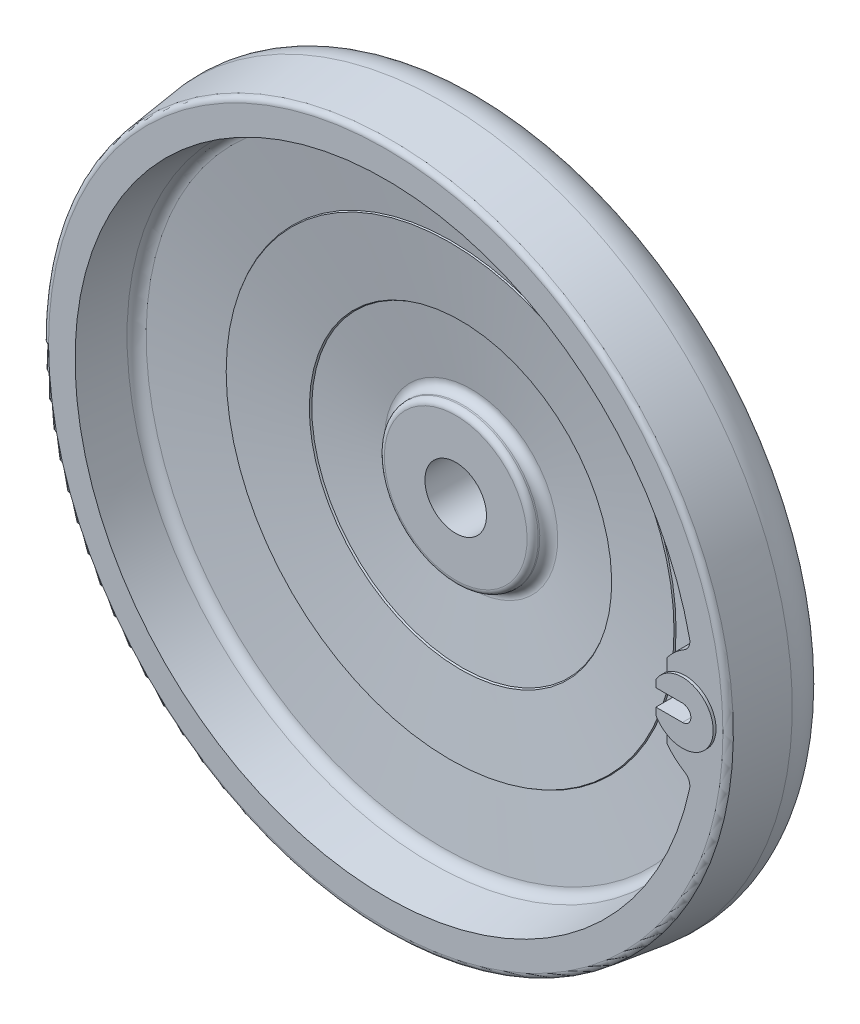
ISO-10303-21;
HEADER;
FILE_DESCRIPTION(('STEP AP214'),'2;1');
FILE_NAME('part.step','',(''),(''),'','','');
FILE_SCHEMA(('AUTOMOTIVE_DESIGN { 1 0 10303 214 1 1 1 1 }'));
ENDSEC;
DATA;
#1=APPLICATION_CONTEXT('core data for automotive mechanical design processes');
#2=APPLICATION_PROTOCOL_DEFINITION('international standard','automotive_design',2000,#1);
#3=PRODUCT_CONTEXT('',#1,'mechanical');
#4=PRODUCT('Part','Part','',(#3));
#5=PRODUCT_RELATED_PRODUCT_CATEGORY('part','',(#4));
#6=PRODUCT_DEFINITION_FORMATION('','',#4);
#7=PRODUCT_DEFINITION_CONTEXT('part definition',#1,'design');
#8=PRODUCT_DEFINITION('design','',#6,#7);
#9=PRODUCT_DEFINITION_SHAPE('','',#8);
#10=(LENGTH_UNIT() NAMED_UNIT(*) SI_UNIT(.MILLI.,.METRE.));
#11=(NAMED_UNIT(*) PLANE_ANGLE_UNIT() SI_UNIT($,.RADIAN.));
#12=(NAMED_UNIT(*) SI_UNIT($,.STERADIAN.) SOLID_ANGLE_UNIT());
#13=UNCERTAINTY_MEASURE_WITH_UNIT(LENGTH_MEASURE(1.E-05),#10,'distance_accuracy_value','');
#14=(GEOMETRIC_REPRESENTATION_CONTEXT(3) GLOBAL_UNCERTAINTY_ASSIGNED_CONTEXT((#13)) GLOBAL_UNIT_ASSIGNED_CONTEXT((#10,
#11,#12)) REPRESENTATION_CONTEXT('',''));
#15=CARTESIAN_POINT('',(0.,0.,0.));
#16=DIRECTION('',(0.,0.,1.));
#17=DIRECTION('',(1.,0.,0.));
#18=AXIS2_PLACEMENT_3D('',#15,#16,#17);
#19=CARTESIAN_POINT('',(97.5,2.99999999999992,46.5));
#20=DIRECTION('',(0.,-1.,0.));
#21=DIRECTION('',(0.,0.,-1.));
#22=AXIS2_PLACEMENT_3D('',#19,#20,#21);
#23=PLANE('',#22);
#24=DIRECTION('',(0.,0.,1.));
#25=VECTOR('',#24,1.);
#26=CARTESIAN_POINT('',(107.,2.99999999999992,46.5));
#27=LINE('',#26,#25);
#28=CARTESIAN_POINT('',(107.,2.99999999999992,46.5));
#29=VERTEX_POINT('',#28);
#30=CARTESIAN_POINT('',(107.,2.99999999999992,51.75));
#31=VERTEX_POINT('',#30);
#32=EDGE_CURVE('E465',#29,#31,#27,.T.);
#33=ORIENTED_EDGE('',*,*,#32,.T.);
#34=CARTESIAN_POINT('',(107.,2.99999999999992,52.5));
#35=DIRECTION('',(0.,-1.,0.));
#36=DIRECTION('',(0.,0.,-1.));
#37=AXIS2_PLACEMENT_3D('',#34,#35,#36);
#38=CIRCLE('',#37,0.749999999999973);
#39=CARTESIAN_POINT('',(107.,2.99999999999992,53.25));
#40=VERTEX_POINT('',#39);
#41=EDGE_CURVE('E486',#31,#40,#38,.F.);
#42=ORIENTED_EDGE('',*,*,#41,.T.);
#43=CARTESIAN_POINT('',(107.,2.99999999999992,62.));
#44=VERTEX_POINT('',#43);
#45=EDGE_CURVE('E466',#40,#44,#27,.T.);
#46=ORIENTED_EDGE('',*,*,#45,.T.);
#47=DIRECTION('',(1.,0.,0.));
#48=VECTOR('',#47,1.);
#49=CARTESIAN_POINT('',(97.5,2.99999999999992,62.));
#50=LINE('',#49,#48);
#51=CARTESIAN_POINT('',(97.5,2.99999999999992,62.));
#52=VERTEX_POINT('',#51);
#53=EDGE_CURVE('E480',#52,#44,#50,.T.);
#54=ORIENTED_EDGE('',*,*,#53,.F.);
#55=DIRECTION('',(0.,0.,1.));
#56=VECTOR('',#55,1.);
#57=CARTESIAN_POINT('',(97.5,2.99999999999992,46.5));
#58=LINE('',#57,#56);
#59=CARTESIAN_POINT('',(97.5,2.99999999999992,46.5));
#60=VERTEX_POINT('',#59);
#61=EDGE_CURVE('E462',#60,#52,#58,.T.);
#62=ORIENTED_EDGE('',*,*,#61,.F.);
#63=DIRECTION('',(1.,0.,0.));
#64=VECTOR('',#63,1.);
#65=CARTESIAN_POINT('',(97.5,2.99999999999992,46.5));
#66=LINE('',#65,#64);
#67=EDGE_CURVE('E469',#60,#29,#66,.T.);
#68=ORIENTED_EDGE('',*,*,#67,.T.);
#69=EDGE_LOOP('',(#33,#42,#46,#54,#62,#68));
#70=FACE_BOUND('',#69,.T.);
#71=ADVANCED_FACE('F14',(#70),#23,.T.);
#72=CARTESIAN_POINT('',(107.,0.,46.5));
#73=DIRECTION('',(0.,0.,1.));
#74=DIRECTION('',(0.,-1.,0.));
#75=AXIS2_PLACEMENT_3D('',#72,#73,#74);
#76=CYLINDRICAL_SURFACE('',#75,2.99999999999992);
#77=CARTESIAN_POINT('',(107.,2.99999999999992,51.75));
#78=CARTESIAN_POINT('',(107.041512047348,3.00003192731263,51.7499611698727));
#79=CARTESIAN_POINT('',(107.082999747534,2.99913939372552,51.7534438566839));
#80=CARTESIAN_POINT('',(107.164699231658,2.99574554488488,51.7671490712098));
#81=CARTESIAN_POINT('',(107.204913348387,2.99324737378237,51.7773584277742));
#82=CARTESIAN_POINT('',(107.283008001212,2.98688078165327,51.8042154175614));
#83=CARTESIAN_POINT('',(107.320888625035,2.98301241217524,51.8208628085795));
#84=CARTESIAN_POINT('',(107.39332879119,2.97432705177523,51.8600869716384));
#85=CARTESIAN_POINT('',(107.42788756,2.96950984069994,51.8826651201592));
#86=CARTESIAN_POINT('',(107.493399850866,2.95933743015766,51.9335992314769));
#87=CARTESIAN_POINT('',(107.524275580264,2.95397398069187,51.9620536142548));
#88=CARTESIAN_POINT('',(107.58087251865,2.94336844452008,52.0237236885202));
#89=CARTESIAN_POINT('',(107.606592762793,2.93812638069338,52.0569402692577));
#90=CARTESIAN_POINT('',(107.652513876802,2.92827376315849,52.127798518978));
#91=CARTESIAN_POINT('',(107.672627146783,2.92367373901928,52.1654985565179));
#92=CARTESIAN_POINT('',(107.706199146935,2.91574729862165,52.2438763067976));
#93=CARTESIAN_POINT('',(107.719659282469,2.91242061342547,52.2845533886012));
#94=CARTESIAN_POINT('',(107.739277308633,2.90750241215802,52.366871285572));
#95=CARTESIAN_POINT('',(107.745575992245,2.90587749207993,52.408476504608));
#96=CARTESIAN_POINT('',(107.751130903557,2.9044468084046,52.4921833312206));
#97=CARTESIAN_POINT('',(107.750388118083,2.90464078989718,52.5342848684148));
#98=CARTESIAN_POINT('',(107.741993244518,2.90679603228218,52.6167080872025));
#99=CARTESIAN_POINT('',(107.734509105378,2.90871433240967,52.6570481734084));
#100=CARTESIAN_POINT('',(107.713111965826,2.91403357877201,52.7358808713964));
#101=CARTESIAN_POINT('',(107.699198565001,2.91743461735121,52.7743733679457));
#102=CARTESIAN_POINT('',(107.665194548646,2.92537561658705,52.8488694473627));
#103=CARTESIAN_POINT('',(107.645042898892,2.92992674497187,52.8848439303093));
#104=CARTESIAN_POINT('',(107.599177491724,2.93964867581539,52.9529601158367));
#105=CARTESIAN_POINT('',(107.573462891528,2.94481957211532,52.9851012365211));
#106=CARTESIAN_POINT('',(107.516335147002,2.95537879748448,53.045598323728));
#107=CARTESIAN_POINT('',(107.484780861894,2.9607691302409,53.0738208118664));
#108=CARTESIAN_POINT('',(107.417313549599,2.97102871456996,53.1246055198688));
#109=CARTESIAN_POINT('',(107.381399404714,2.97589783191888,53.1471662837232));
#110=CARTESIAN_POINT('',(107.30603590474,2.98459146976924,53.1860376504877));
#111=CARTESIAN_POINT('',(107.266573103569,2.98841177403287,53.2023231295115));
#112=CARTESIAN_POINT('',(107.1853763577,2.99454248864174,53.2279711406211));
#113=CARTESIAN_POINT('',(107.143645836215,2.99685510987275,53.2373438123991));
#114=CARTESIAN_POINT('',(107.084629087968,2.99885383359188,53.2454043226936));
#115=CARTESIAN_POINT('',(107.067737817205,2.99928307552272,53.247128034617));
#116=CARTESIAN_POINT('',(107.033900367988,2.99985600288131,53.2494245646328));
#117=CARTESIAN_POINT('',(107.016954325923,3.00000015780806,53.2499992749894));
#118=CARTESIAN_POINT('',(107.,2.99999999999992,53.25));
#119=B_SPLINE_CURVE_WITH_KNOTS('',3,(#77,#78,#79,#80,#81,#82,#83,#84,#85,#86,#87,#88,#89,#90,
#91,#92,#93,#94,#95,#96,#97,#98,#99,#100,#101,#102,#103,#104,#105,#106,#107,#108,#109,#110,#111,
#112,#113,#114,#115,#116,#117,#118),.UNSPECIFIED.,.F.,.F.,(4,2,2,2,2,2,2,2,2,2,2,2,2,2,2,2,2,2,
2,2,4),(0.,0.124343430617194,0.248444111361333,0.372540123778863,0.496664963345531,
0.623067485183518,0.749493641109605,0.877796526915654,1.00607229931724,1.13178005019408,
1.25747018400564,1.38011302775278,1.50276351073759,1.6266540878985,1.75056344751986,
1.87799307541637,2.00545544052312,2.13342294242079,2.26120236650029,2.31212245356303,
2.36295861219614),.UNSPECIFIED.);
#120=EDGE_CURVE('E29',#31,#40,#119,.T.);
#121=ORIENTED_EDGE('',*,*,#120,.F.);
#122=ORIENTED_EDGE('',*,*,#32,.F.);
#123=CARTESIAN_POINT('',(107.,0.,46.5));
#124=DIRECTION('',(0.,0.,1.));
#125=DIRECTION('',(0.,-1.,0.));
#126=AXIS2_PLACEMENT_3D('',#123,#124,#125);
#127=CIRCLE('',#126,2.99999999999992);
#128=CARTESIAN_POINT('',(107.,-2.99999999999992,46.5));
#129=VERTEX_POINT('',#128);
#130=EDGE_CURVE('E472',#129,#29,#127,.T.);
#131=ORIENTED_EDGE('',*,*,#130,.F.);
#132=DIRECTION('',(0.,0.,1.));
#133=VECTOR('',#132,1.);
#134=CARTESIAN_POINT('',(107.,-2.99999999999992,46.5));
#135=LINE('',#134,#133);
#136=CARTESIAN_POINT('',(107.,-2.99999999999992,51.75));
#137=VERTEX_POINT('',#136);
#138=EDGE_CURVE('E136',#129,#137,#135,.T.);
#139=ORIENTED_EDGE('',*,*,#138,.T.);
#140=CARTESIAN_POINT('',(107.,-2.99999999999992,53.25));
#141=CARTESIAN_POINT('',(107.041512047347,-3.00003192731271,53.2500388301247));
#142=CARTESIAN_POINT('',(107.082999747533,-2.99913939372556,53.2465561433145));
#143=CARTESIAN_POINT('',(107.164699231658,-2.99574554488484,53.2328509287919));
#144=CARTESIAN_POINT('',(107.204913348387,-2.99324737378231,53.2226415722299));
#145=CARTESIAN_POINT('',(107.283008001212,-2.98688078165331,53.1957845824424));
#146=CARTESIAN_POINT('',(107.320888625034,-2.9830124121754,53.1791371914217));
#147=CARTESIAN_POINT('',(107.393328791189,-2.97432705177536,53.1399130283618));
#148=CARTESIAN_POINT('',(107.42788756,-2.96950984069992,53.1173348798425));
#149=CARTESIAN_POINT('',(107.493399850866,-2.9593374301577,53.0664007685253));
#150=CARTESIAN_POINT('',(107.524275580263,-2.95397398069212,53.0379463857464));
#151=CARTESIAN_POINT('',(107.580872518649,-2.9433684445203,52.9762763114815));
#152=CARTESIAN_POINT('',(107.606592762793,-2.93812638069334,52.9430597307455));
#153=CARTESIAN_POINT('',(107.652513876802,-2.92827376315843,52.8722014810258));
#154=CARTESIAN_POINT('',(107.672627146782,-2.92367373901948,52.8345014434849));
#155=CARTESIAN_POINT('',(107.706199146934,-2.91574729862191,52.7561236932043));
#156=CARTESIAN_POINT('',(107.719659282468,-2.91242061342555,52.7154466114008));
#157=CARTESIAN_POINT('',(107.739277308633,-2.90750241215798,52.6331287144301));
#158=CARTESIAN_POINT('',(107.745575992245,-2.90587749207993,52.5915234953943));
#159=CARTESIAN_POINT('',(107.751130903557,-2.90444680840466,52.5078166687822));
#160=CARTESIAN_POINT('',(107.750388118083,-2.90464078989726,52.4657151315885));
#161=CARTESIAN_POINT('',(107.741993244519,-2.90679603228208,52.3832919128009));
#162=CARTESIAN_POINT('',(107.734509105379,-2.9087143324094,52.3429518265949));
#163=CARTESIAN_POINT('',(107.713111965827,-2.91403357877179,52.2641191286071));
#164=CARTESIAN_POINT('',(107.699198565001,-2.91743461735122,52.2256266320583));
#165=CARTESIAN_POINT('',(107.665194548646,-2.92537561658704,52.1511305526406));
#166=CARTESIAN_POINT('',(107.645042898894,-2.9299267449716,52.1151560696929));
#167=CARTESIAN_POINT('',(107.599177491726,-2.93964867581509,52.047039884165));
#168=CARTESIAN_POINT('',(107.573462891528,-2.94481957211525,52.0148987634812));
#169=CARTESIAN_POINT('',(107.516335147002,-2.9553787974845,51.9544016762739));
#170=CARTESIAN_POINT('',(107.484780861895,-2.96076913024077,51.9261791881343));
#171=CARTESIAN_POINT('',(107.4173135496,-2.97102871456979,51.8753944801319));
#172=CARTESIAN_POINT('',(107.381399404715,-2.97589783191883,51.8528337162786));
#173=CARTESIAN_POINT('',(107.30603590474,-2.98459146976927,51.813962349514));
#174=CARTESIAN_POINT('',(107.266573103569,-2.98841177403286,51.7976768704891));
#175=CARTESIAN_POINT('',(107.1853763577,-2.9945424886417,51.7720288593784));
#176=CARTESIAN_POINT('',(107.143645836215,-2.99685510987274,51.7626561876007));
#177=CARTESIAN_POINT('',(107.084629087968,-2.99885383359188,51.7545956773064));
#178=CARTESIAN_POINT('',(107.067737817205,-2.99928307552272,51.752871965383));
#179=CARTESIAN_POINT('',(107.033900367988,-2.99985600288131,51.7505754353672));
#180=CARTESIAN_POINT('',(107.016954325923,-3.00000015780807,51.7500007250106));
#181=CARTESIAN_POINT('',(107.,-2.99999999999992,51.75));
#182=B_SPLINE_CURVE_WITH_KNOTS('',3,(#140,#141,#142,#143,#144,#145,#146,#147,#148,#149,#150,
#151,#152,#153,#154,#155,#156,#157,#158,#159,#160,#161,#162,#163,#164,#165,#166,#167,#168,#169,
#170,#171,#172,#173,#174,#175,#176,#177,#178,#179,#180,#181),.UNSPECIFIED.,.F.,.F.,(4,2,2,2,2,2,
2,2,2,2,2,2,2,2,2,2,2,2,2,2,4),(0.,0.124343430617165,0.248444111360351,0.372540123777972,
0.49666496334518,0.623067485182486,0.749493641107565,0.87779652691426,1.00607229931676,
1.13178005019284,1.25747018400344,1.38011302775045,1.50276351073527,1.62665408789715,
1.7505634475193,1.87799307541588,2.00545544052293,2.13342294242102,2.26120236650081,
2.31212245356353,2.36295861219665),.UNSPECIFIED.);
#183=CARTESIAN_POINT('',(107.,-2.99999999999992,53.25));
#184=VERTEX_POINT('',#183);
#185=EDGE_CURVE('E140',#184,#137,#182,.T.);
#186=ORIENTED_EDGE('',*,*,#185,.F.);
#187=CARTESIAN_POINT('',(107.,-2.99999999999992,62.));
#188=VERTEX_POINT('',#187);
#189=EDGE_CURVE('E129',#184,#188,#135,.T.);
#190=ORIENTED_EDGE('',*,*,#189,.T.);
#191=CARTESIAN_POINT('',(107.,0.,62.));
#192=DIRECTION('',(0.,0.,1.));
#193=DIRECTION('',(0.,-1.,0.));
#194=AXIS2_PLACEMENT_3D('',#191,#192,#193);
#195=CIRCLE('',#194,2.99999999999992);
#196=EDGE_CURVE('E483',#188,#44,#195,.T.);
#197=ORIENTED_EDGE('',*,*,#196,.T.);
#198=ORIENTED_EDGE('',*,*,#45,.F.);
#199=EDGE_LOOP('',(#121,#122,#131,#139,#186,#190,#197,#198));
#200=FACE_BOUND('',#199,.T.);
#201=ADVANCED_FACE('F141',(#200),#76,.F.);
#202=CARTESIAN_POINT('',(97.5,-2.99999999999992,46.5));
#203=DIRECTION('',(0.,-1.,0.));
#204=DIRECTION('',(-1.,0.,0.));
#205=AXIS2_PLACEMENT_3D('',#202,#203,#204);
#206=PLANE('',#205);
#207=CARTESIAN_POINT('',(107.,-2.99999999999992,52.5));
#208=DIRECTION('',(0.,-1.,0.));
#209=DIRECTION('',(-1.,0.,0.));
#210=AXIS2_PLACEMENT_3D('',#207,#208,#209);
#211=CIRCLE('',#210,0.749999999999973);
#212=EDGE_CURVE('E9',#137,#184,#211,.F.);
#213=ORIENTED_EDGE('',*,*,#212,.F.);
#214=ORIENTED_EDGE('',*,*,#138,.F.);
#215=DIRECTION('',(1.,0.,0.));
#216=VECTOR('',#215,1.);
#217=CARTESIAN_POINT('',(97.5,-2.99999999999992,46.5));
#218=LINE('',#217,#216);
#219=CARTESIAN_POINT('',(97.5,-2.99999999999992,46.5));
#220=VERTEX_POINT('',#219);
#221=EDGE_CURVE('E475',#220,#129,#218,.T.);
#222=ORIENTED_EDGE('',*,*,#221,.F.);
#223=DIRECTION('',(0.,0.,1.));
#224=VECTOR('',#223,1.);
#225=CARTESIAN_POINT('',(97.5,-2.99999999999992,46.5));
#226=LINE('',#225,#224);
#227=CARTESIAN_POINT('',(97.5,-2.99999999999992,62.));
#228=VERTEX_POINT('',#227);
#229=EDGE_CURVE('E137',#220,#228,#226,.T.);
#230=ORIENTED_EDGE('',*,*,#229,.T.);
#231=DIRECTION('',(1.,0.,0.));
#232=VECTOR('',#231,1.);
#233=CARTESIAN_POINT('',(97.5,-2.99999999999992,62.));
#234=LINE('',#233,#232);
#235=EDGE_CURVE('E133',#228,#188,#234,.T.);
#236=ORIENTED_EDGE('',*,*,#235,.T.);
#237=ORIENTED_EDGE('',*,*,#189,.F.);
#238=EDGE_LOOP('',(#213,#214,#222,#230,#236,#237));
#239=FACE_BOUND('',#238,.T.);
#240=ADVANCED_FACE('F131',(#239),#206,.F.);
#241=CARTESIAN_POINT('',(97.5,5.54526825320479,38.));
#242=DIRECTION('',(-1.,0.,0.));
#243=DIRECTION('',(0.,1.,0.));
#244=AXIS2_PLACEMENT_3D('',#241,#242,#243);
#245=PLANE('',#244);
#246=DIRECTION('',(0.,-1.,0.));
#247=VECTOR('',#246,1.);
#248=CARTESIAN_POINT('',(97.5,2.99999999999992,46.5));
#249=LINE('',#248,#247);
#250=EDGE_CURVE('E478',#60,#220,#249,.T.);
#251=ORIENTED_EDGE('',*,*,#250,.F.);
#252=ORIENTED_EDGE('',*,*,#61,.T.);
#253=DIRECTION('',(0.,-1.,0.));
#254=VECTOR('',#253,1.);
#255=CARTESIAN_POINT('',(97.5,5.54526825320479,62.));
#256=LINE('',#255,#254);
#257=CARTESIAN_POINT('',(97.5,5.54526825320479,62.));
#258=VERTEX_POINT('',#257);
#259=EDGE_CURVE('E455',#258,#52,#256,.T.);
#260=ORIENTED_EDGE('',*,*,#259,.F.);
#261=DIRECTION('',(0.,0.,1.));
#262=VECTOR('',#261,1.);
#263=CARTESIAN_POINT('',(97.5,5.54526825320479,38.));
#264=LINE('',#263,#262);
#265=CARTESIAN_POINT('',(97.5,5.54526825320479,40.0225092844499));
#266=VERTEX_POINT('',#265);
#267=EDGE_CURVE('E451',#266,#258,#264,.T.);
#268=ORIENTED_EDGE('',*,*,#267,.F.);
#269=CARTESIAN_POINT('',(97.5,18.6999564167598,40.2538683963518));
#270=CARTESIAN_POINT('',(97.5,17.4881626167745,40.2212576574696));
#271=CARTESIAN_POINT('',(97.5,16.276288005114,40.1917080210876));
#272=CARTESIAN_POINT('',(97.5,13.8524018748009,40.138835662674));
#273=CARTESIAN_POINT('',(97.5,12.6403903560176,40.1155129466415));
#274=CARTESIAN_POINT('',(97.5,9.0044708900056,40.0550469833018));
#275=CARTESIAN_POINT('',(97.5,6.58039821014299,40.0273983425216));
#276=CARTESIAN_POINT('',(97.5,1.73208993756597,39.9979005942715));
#277=CARTESIAN_POINT('',(97.5,-0.692145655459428,39.9960515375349));
#278=CARTESIAN_POINT('',(97.5,-4.32853719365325,40.0126440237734));
#279=CARTESIAN_POINT('',(97.5,-5.54074395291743,40.0214035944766));
#280=CARTESIAN_POINT('',(97.5,-7.96509387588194,40.045332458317));
#281=CARTESIAN_POINT('',(97.5,-9.17723703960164,40.0605017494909));
#282=CARTESIAN_POINT('',(97.5,-10.3893339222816,40.0788524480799));
#283=B_SPLINE_CURVE_WITH_KNOTS('',3,(#269,#270,#271,#272,#273,#274,#275,#276,#277,#278,#279,
#280,#281,#282),.UNSPECIFIED.,.F.,.F.,(4,2,2,2,2,2,4),(0.,3.63669024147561,7.27338398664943,
14.5459317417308,21.8184937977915,25.4551941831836,29.0918934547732),.UNSPECIFIED.);
#284=CARTESIAN_POINT('',(97.5,-5.54526825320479,40.0225092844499));
#285=VERTEX_POINT('',#284);
#286=EDGE_CURVE('E22',#266,#285,#283,.T.);
#287=ORIENTED_EDGE('',*,*,#286,.T.);
#288=DIRECTION('',(0.,0.,1.));
#289=VECTOR('',#288,1.);
#290=CARTESIAN_POINT('',(97.5,-5.54526825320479,38.));
#291=LINE('',#290,#289);
#292=CARTESIAN_POINT('',(97.5,-5.54526825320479,62.));
#293=VERTEX_POINT('',#292);
#294=EDGE_CURVE('E449',#285,#293,#291,.T.);
#295=ORIENTED_EDGE('',*,*,#294,.T.);
#296=EDGE_CURVE('E458',#228,#293,#256,.T.);
#297=ORIENTED_EDGE('',*,*,#296,.F.);
#298=ORIENTED_EDGE('',*,*,#229,.F.);
#299=EDGE_LOOP('',(#251,#252,#260,#268,#287,#295,#297,#298));
#300=FACE_BOUND('',#299,.T.);
#301=ADVANCED_FACE('F175',(#300),#245,.T.);
#302=CARTESIAN_POINT('',(107.,0.,62.));
#303=DIRECTION('',(0.,0.,1.));
#304=DIRECTION('',(0.,-1.,0.));
#305=AXIS2_PLACEMENT_3D('',#302,#303,#304);
#306=PLANE('',#305);
#307=ORIENTED_EDGE('',*,*,#259,.T.);
#308=ORIENTED_EDGE('',*,*,#53,.T.);
#309=ORIENTED_EDGE('',*,*,#196,.F.);
#310=ORIENTED_EDGE('',*,*,#235,.F.);
#311=ORIENTED_EDGE('',*,*,#296,.T.);
#312=CARTESIAN_POINT('',(107.,0.,62.));
#313=DIRECTION('',(0.,0.,1.));
#314=DIRECTION('',(0.,-1.,0.));
#315=AXIS2_PLACEMENT_3D('',#312,#313,#314);
#316=CIRCLE('',#315,11.);
#317=EDGE_CURVE('E459',#293,#258,#316,.T.);
#318=ORIENTED_EDGE('',*,*,#317,.T.);
#319=EDGE_LOOP('',(#307,#308,#309,#310,#311,#318));
#320=FACE_BOUND('',#319,.T.);
#321=ADVANCED_FACE('F171',(#320),#306,.T.);
#322=CARTESIAN_POINT('',(100.5,13.3322916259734,39.));
#323=DIRECTION('',(-1.,0.,0.));
#324=DIRECTION('',(0.,1.,0.));
#325=AXIS2_PLACEMENT_3D('',#322,#323,#324);
#326=PLANE('',#325);
#327=DIRECTION('',(0.,0.,1.));
#328=VECTOR('',#327,1.);
#329=CARTESIAN_POINT('',(100.5,-8.87411967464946,38.));
#330=LINE('',#329,#328);
#331=CARTESIAN_POINT('',(100.5,-8.87411967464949,40.4844329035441));
#332=VERTEX_POINT('',#331);
#333=CARTESIAN_POINT('',(100.5,-8.87411967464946,61.));
#334=VERTEX_POINT('',#333);
#335=EDGE_CURVE('E436',#332,#334,#330,.T.);
#336=ORIENTED_EDGE('',*,*,#335,.F.);
#337=CARTESIAN_POINT('',(100.5,37.4075636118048,41.3908678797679));
#338=CARTESIAN_POINT('',(100.5,35.12414529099,41.2770515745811));
#339=CARTESIAN_POINT('',(100.5,32.8402593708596,41.1724120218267));
#340=CARTESIAN_POINT('',(100.5,28.2716577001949,40.9825741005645));
#341=CARTESIAN_POINT('',(100.5,25.9869419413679,40.8973759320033));
#342=CARTESIAN_POINT('',(100.5,21.4176504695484,40.7475376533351));
#343=CARTESIAN_POINT('',(100.5,19.1330749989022,40.6828901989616));
#344=CARTESIAN_POINT('',(100.5,14.5634260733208,40.5749585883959));
#345=CARTESIAN_POINT('',(100.5,12.2783526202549,40.5316743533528));
#346=CARTESIAN_POINT('',(100.5,7.7078302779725,40.4670694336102));
#347=CARTESIAN_POINT('',(100.5,5.42238138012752,40.4457493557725));
#348=CARTESIAN_POINT('',(100.5,0.851380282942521,40.425377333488));
#349=CARTESIAN_POINT('',(100.5,-1.43417191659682,40.4263254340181));
#350=CARTESIAN_POINT('',(100.5,-6.00597508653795,40.4504822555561));
#351=CARTESIAN_POINT('',(100.5,-8.29222601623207,40.4736988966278));
#352=CARTESIAN_POINT('',(100.5,-11.7213459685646,40.5249760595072));
#353=CARTESIAN_POINT('',(100.5,-12.8643438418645,40.5448104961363));
#354=CARTESIAN_POINT('',(100.5,-15.1502322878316,40.5898880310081));
#355=CARTESIAN_POINT('',(100.5,-16.293122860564,40.6151311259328));
#356=CARTESIAN_POINT('',(100.5,-17.4359497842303,40.6430408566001));
#357=B_SPLINE_CURVE_WITH_KNOTS('',3,(#337,#338,#339,#340,#341,#342,#343,#344,#345,#346,#347,
#348,#349,#350,#351,#352,#353,#354,#355,#356),.UNSPECIFIED.,.F.,.F.,(4,2,2,2,2,2,2,2,2,4),(0.,
6.85875605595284,13.7175826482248,20.5739553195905,27.4303026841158,34.2868394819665,
41.1433901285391,48.0023802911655,51.4318791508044,54.8613759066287),.UNSPECIFIED.);
#358=CARTESIAN_POINT('',(100.5,-13.3322916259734,40.5543530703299));
#359=VERTEX_POINT('',#358);
#360=EDGE_CURVE('E244',#332,#359,#357,.T.);
#361=ORIENTED_EDGE('',*,*,#360,.T.);
#362=DIRECTION('',(0.,0.,1.));
#363=VECTOR('',#362,1.);
#364=CARTESIAN_POINT('',(100.5,-13.3322916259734,39.));
#365=LINE('',#364,#363);
#366=CARTESIAN_POINT('',(100.5,-13.3322916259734,61.));
#367=VERTEX_POINT('',#366);
#368=EDGE_CURVE('E410',#359,#367,#365,.T.);
#369=ORIENTED_EDGE('',*,*,#368,.T.);
#370=DIRECTION('',(0.,-1.,0.));
#371=VECTOR('',#370,1.);
#372=CARTESIAN_POINT('',(100.5,13.3322916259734,61.));
#373=LINE('',#372,#371);
#374=EDGE_CURVE('E430',#334,#367,#373,.T.);
#375=ORIENTED_EDGE('',*,*,#374,.F.);
#376=EDGE_LOOP('',(#336,#361,#369,#375));
#377=FACE_BOUND('',#376,.T.);
#378=ADVANCED_FACE('F174',(#377),#326,.T.);
#379=CARTESIAN_POINT('',(0.,0.,61.));
#380=DIRECTION('',(0.,0.,1.));
#381=DIRECTION('',(0.,-1.,0.));
#382=AXIS2_PLACEMENT_3D('',#379,#380,#381);
#383=CONICAL_SURFACE('',#382,111.,0.129702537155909);
#384=CARTESIAN_POINT('',(108.560348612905,23.1441290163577,60.99999996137));
#385=CARTESIAN_POINT('',(108.567566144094,23.110354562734,61.0001240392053));
#386=CARTESIAN_POINT('',(108.574284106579,23.0766370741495,60.9967251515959));
#387=CARTESIAN_POINT('',(108.586586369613,23.0106405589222,60.9839496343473));
#388=CARTESIAN_POINT('',(108.592185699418,22.9783477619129,60.9746604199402));
#389=CARTESIAN_POINT('',(108.60382462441,22.9062220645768,60.9476446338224));
#390=CARTESIAN_POINT('',(108.609506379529,22.8669768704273,60.928236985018));
#391=CARTESIAN_POINT('',(108.619374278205,22.7916403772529,60.88346894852));
#392=CARTESIAN_POINT('',(108.623550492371,22.7555711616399,60.8580708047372));
#393=CARTESIAN_POINT('',(108.633658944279,22.6578065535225,60.7804708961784));
#394=CARTESIAN_POINT('',(108.638159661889,22.5997691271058,60.7235546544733));
#395=CARTESIAN_POINT('',(108.644548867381,22.4914738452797,60.6028129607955));
#396=CARTESIAN_POINT('',(108.646431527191,22.4412335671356,60.5389724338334));
#397=CARTESIAN_POINT('',(108.648269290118,22.3535218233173,60.4170229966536));
#398=CARTESIAN_POINT('',(108.648469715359,22.3152630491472,60.3594765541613));
#399=CARTESIAN_POINT('',(108.647895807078,22.2419996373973,60.2423387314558));
#400=CARTESIAN_POINT('',(108.647120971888,22.2069966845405,60.1827463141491));
#401=CARTESIAN_POINT('',(108.643667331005,22.1057538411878,60.0015890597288));
#402=CARTESIAN_POINT('',(108.639858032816,22.043430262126,59.8778661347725));
#403=CARTESIAN_POINT('',(108.630240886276,21.9256458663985,59.6264884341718));
#404=CARTESIAN_POINT('',(108.624421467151,21.8702273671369,59.4988148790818));
#405=CARTESIAN_POINT('',(108.611352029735,21.7648735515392,59.2415143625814));
#406=CARTESIAN_POINT('',(108.60410395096,21.7149309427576,59.1118902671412));
#407=CARTESIAN_POINT('',(108.587090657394,21.6104401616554,58.8272312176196));
#408=CARTESIAN_POINT('',(108.577107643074,21.5567319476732,58.6719035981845));
#409=CARTESIAN_POINT('',(108.555982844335,21.4538791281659,58.3598149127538));
#410=CARTESIAN_POINT('',(108.544840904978,21.4047351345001,58.2030536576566));
#411=CARTESIAN_POINT('',(108.510039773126,21.2627383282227,57.7310674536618));
#412=CARTESIAN_POINT('',(108.485014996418,21.1753750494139,57.4142945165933));
#413=CARTESIAN_POINT('',(108.432428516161,21.0107514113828,56.7776083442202));
#414=CARTESIAN_POINT('',(108.404860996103,20.933515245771,56.4576894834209));
#415=CARTESIAN_POINT('',(108.347874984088,20.786969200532,55.8163152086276));
#416=CARTESIAN_POINT('',(108.318457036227,20.7176570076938,55.4948602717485));
#417=CARTESIAN_POINT('',(108.258179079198,20.5853610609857,54.8509060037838));
#418=CARTESIAN_POINT('',(108.227319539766,20.5223752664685,54.5284070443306));
#419=CARTESIAN_POINT('',(108.164418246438,20.4016212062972,53.8825292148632));
#420=CARTESIAN_POINT('',(108.132376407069,20.3438533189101,53.559150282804));
#421=CARTESIAN_POINT('',(108.06734722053,20.232828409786,52.912137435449));
#422=CARTESIAN_POINT('',(108.034361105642,20.1795658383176,52.5885043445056));
#423=CARTESIAN_POINT('',(107.967546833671,20.0768931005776,51.9407129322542));
#424=CARTESIAN_POINT('',(107.933718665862,20.0274829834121,51.6165546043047));
#425=CARTESIAN_POINT('',(107.840565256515,19.8974990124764,50.7328691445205));
#426=CARTESIAN_POINT('',(107.780519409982,19.8202748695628,50.1729243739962));
#427=CARTESIAN_POINT('',(107.658641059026,19.6742155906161,49.0519256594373));
#428=CARTESIAN_POINT('',(107.596807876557,19.6053836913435,48.4908713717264));
#429=CARTESIAN_POINT('',(107.472037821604,19.4753733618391,47.3715098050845));
#430=CARTESIAN_POINT('',(107.409109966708,19.4141508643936,46.8132066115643));
#431=CARTESIAN_POINT('',(107.282004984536,19.2981117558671,45.6963372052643));
#432=CARTESIAN_POINT('',(107.217828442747,19.243292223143,45.1377712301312));
#433=CARTESIAN_POINT('',(107.153107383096,19.1912655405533,44.5790187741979));
#434=B_SPLINE_CURVE_WITH_KNOTS('',3,(#384,#385,#386,#387,#388,#389,#390,#391,#392,#393,#394,
#395,#396,#397,#398,#399,#400,#401,#402,#403,#404,#405,#406,#407,#408,#409,#410,#411,#412,#413,
#414,#415,#416,#417,#418,#419,#420,#421,#422,#423,#424,#425,#426,#427,#428,#429,#430,#431,#432,
#433),.UNSPECIFIED.,.F.,.F.,(4,2,2,2,2,2,2,2,2,2,2,2,2,2,2,2,2,2,2,2,2,2,2,2,4),(0.,
0.103181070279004,0.20486561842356,0.336562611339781,0.46911293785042,0.711987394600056,
0.955401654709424,1.16256266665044,1.36983028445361,1.78516624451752,2.20293396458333,
2.62013839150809,3.1140030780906,3.607933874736,4.59628696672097,5.58695980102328,
6.5773426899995,7.56740508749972,8.55753920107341,9.54643532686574,10.5353440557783,
12.240532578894,13.9463767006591,15.6418296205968,17.3365058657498),.UNSPECIFIED.);
#435=CARTESIAN_POINT('',(108.560391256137,23.1439290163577,61.));
#436=VERTEX_POINT('',#435);
#437=CARTESIAN_POINT('',(107.153130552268,19.1912841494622,44.579218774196));
#438=VERTEX_POINT('',#437);
#439=EDGE_CURVE('E279',#436,#438,#434,.T.);
#440=ORIENTED_EDGE('',*,*,#439,.F.);
#441=CARTESIAN_POINT('',(0.,0.,61.));
#442=DIRECTION('',(0.,0.,1.));
#443=DIRECTION('',(0.,-1.,0.));
#444=AXIS2_PLACEMENT_3D('',#441,#442,#443);
#445=CIRCLE('',#444,111.);
#446=CARTESIAN_POINT('',(108.560391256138,-23.1439290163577,61.));
#447=VERTEX_POINT('',#446);
#448=EDGE_CURVE('E383',#436,#447,#445,.T.);
#449=ORIENTED_EDGE('',*,*,#448,.T.);
#450=CARTESIAN_POINT('',(108.560348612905,-23.1441290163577,60.99999996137));
#451=CARTESIAN_POINT('',(108.567566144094,-23.110354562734,61.0001240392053));
#452=CARTESIAN_POINT('',(108.574284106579,-23.0766370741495,60.9967251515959));
#453=CARTESIAN_POINT('',(108.586586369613,-23.0106405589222,60.9839496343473));
#454=CARTESIAN_POINT('',(108.592185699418,-22.9783477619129,60.9746604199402));
#455=CARTESIAN_POINT('',(108.60382462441,-22.9062220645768,60.9476446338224));
#456=CARTESIAN_POINT('',(108.609506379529,-22.8669768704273,60.928236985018));
#457=CARTESIAN_POINT('',(108.619374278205,-22.7916403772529,60.88346894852));
#458=CARTESIAN_POINT('',(108.623550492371,-22.7555711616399,60.8580708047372));
#459=CARTESIAN_POINT('',(108.633658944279,-22.6578065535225,60.7804708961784));
#460=CARTESIAN_POINT('',(108.638159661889,-22.5997691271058,60.7235546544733));
#461=CARTESIAN_POINT('',(108.644548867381,-22.4914738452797,60.6028129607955));
#462=CARTESIAN_POINT('',(108.646431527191,-22.4412335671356,60.5389724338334));
#463=CARTESIAN_POINT('',(108.648269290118,-22.3535218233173,60.4170229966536));
#464=CARTESIAN_POINT('',(108.648469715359,-22.3152630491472,60.3594765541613));
#465=CARTESIAN_POINT('',(108.647895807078,-22.2419996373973,60.2423387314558));
#466=CARTESIAN_POINT('',(108.647120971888,-22.2069966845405,60.1827463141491));
#467=CARTESIAN_POINT('',(108.643667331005,-22.1057538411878,60.0015890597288));
#468=CARTESIAN_POINT('',(108.639858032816,-22.043430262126,59.8778661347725));
#469=CARTESIAN_POINT('',(108.630240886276,-21.9256458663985,59.6264884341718));
#470=CARTESIAN_POINT('',(108.624421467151,-21.8702273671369,59.4988148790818));
#471=CARTESIAN_POINT('',(108.611352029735,-21.7648735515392,59.2415143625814));
#472=CARTESIAN_POINT('',(108.60410395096,-21.7149309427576,59.1118902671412));
#473=CARTESIAN_POINT('',(108.587090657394,-21.6104401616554,58.8272312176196));
#474=CARTESIAN_POINT('',(108.577107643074,-21.5567319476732,58.6719035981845));
#475=CARTESIAN_POINT('',(108.555982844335,-21.4538791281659,58.3598149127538));
#476=CARTESIAN_POINT('',(108.544840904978,-21.4047351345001,58.2030536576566));
#477=CARTESIAN_POINT('',(108.510039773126,-21.2627383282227,57.7310674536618));
#478=CARTESIAN_POINT('',(108.485014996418,-21.1753750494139,57.4142945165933));
#479=CARTESIAN_POINT('',(108.432428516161,-21.0107514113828,56.7776083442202));
#480=CARTESIAN_POINT('',(108.404860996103,-20.933515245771,56.4576894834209));
#481=CARTESIAN_POINT('',(108.347874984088,-20.786969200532,55.8163152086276));
#482=CARTESIAN_POINT('',(108.318457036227,-20.7176570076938,55.4948602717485));
#483=CARTESIAN_POINT('',(108.258179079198,-20.5853610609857,54.8509060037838));
#484=CARTESIAN_POINT('',(108.227319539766,-20.5223752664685,54.5284070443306));
#485=CARTESIAN_POINT('',(108.164418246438,-20.4016212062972,53.8825292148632));
#486=CARTESIAN_POINT('',(108.132376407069,-20.3438533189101,53.559150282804));
#487=CARTESIAN_POINT('',(108.06734722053,-20.232828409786,52.912137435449));
#488=CARTESIAN_POINT('',(108.034361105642,-20.1795658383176,52.5885043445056));
#489=CARTESIAN_POINT('',(107.967546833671,-20.0768931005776,51.9407129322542));
#490=CARTESIAN_POINT('',(107.933718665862,-20.0274829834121,51.6165546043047));
#491=CARTESIAN_POINT('',(107.840565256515,-19.8974990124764,50.7328691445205));
#492=CARTESIAN_POINT('',(107.780519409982,-19.8202748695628,50.1729243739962));
#493=CARTESIAN_POINT('',(107.658641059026,-19.6742155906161,49.0519256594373));
#494=CARTESIAN_POINT('',(107.596807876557,-19.6053836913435,48.4908713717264));
#495=CARTESIAN_POINT('',(107.472037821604,-19.4753733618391,47.3715098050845));
#496=CARTESIAN_POINT('',(107.409109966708,-19.4141508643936,46.8132066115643));
#497=CARTESIAN_POINT('',(107.282004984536,-19.2981117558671,45.6963372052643));
#498=CARTESIAN_POINT('',(107.217828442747,-19.243292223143,45.1377712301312));
#499=CARTESIAN_POINT('',(107.153107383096,-19.1912655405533,44.5790187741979));
#500=B_SPLINE_CURVE_WITH_KNOTS('',3,(#450,#451,#452,#453,#454,#455,#456,#457,#458,#459,#460,
#461,#462,#463,#464,#465,#466,#467,#468,#469,#470,#471,#472,#473,#474,#475,#476,#477,#478,#479,
#480,#481,#482,#483,#484,#485,#486,#487,#488,#489,#490,#491,#492,#493,#494,#495,#496,#497,#498,
#499),.UNSPECIFIED.,.F.,.F.,(4,2,2,2,2,2,2,2,2,2,2,2,2,2,2,2,2,2,2,2,2,2,2,2,4),(0.,
0.103181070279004,0.20486561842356,0.336562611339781,0.46911293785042,0.711987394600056,
0.955401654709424,1.16256266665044,1.36983028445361,1.78516624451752,2.20293396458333,
2.62013839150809,3.1140030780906,3.607933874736,4.59628696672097,5.58695980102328,
6.5773426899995,7.56740508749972,8.55753920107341,9.54643532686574,10.5353440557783,
12.240532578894,13.9463767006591,15.6418296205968,17.3365058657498),.UNSPECIFIED.);
#501=CARTESIAN_POINT('',(107.153130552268,-19.1912841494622,44.579218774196));
#502=VERTEX_POINT('',#501);
#503=EDGE_CURVE('E270',#447,#502,#500,.T.);
#504=ORIENTED_EDGE('',*,*,#503,.T.);
#505=CARTESIAN_POINT('',(0.,0.,44.579218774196));
#506=DIRECTION('',(0.,0.,1.));
#507=DIRECTION('',(0.,-1.,0.));
#508=AXIS2_PLACEMENT_3D('',#505,#506,#507);
#509=CIRCLE('',#508,108.858158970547);
#510=EDGE_CURVE('E380',#438,#502,#509,.T.);
#511=ORIENTED_EDGE('',*,*,#510,.F.);
#512=EDGE_LOOP('',(#440,#449,#504,#511));
#513=FACE_BOUND('',#512,.T.);
#514=ADVANCED_FACE('F264',(#513),#383,.F.);
#515=CARTESIAN_POINT('',(0.,0.,59.));
#516=DIRECTION('',(0.,0.,1.));
#517=DIRECTION('',(0.,-1.,0.));
#518=AXIS2_PLACEMENT_3D('',#515,#516,#517);
#519=TOROIDAL_SURFACE('',#518,120.469795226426,2.0000000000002);
#520=CARTESIAN_POINT('',(0.,0.,59.2586801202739));
#521=DIRECTION('',(0.,0.,1.));
#522=DIRECTION('',(0.,-1.,0.));
#523=AXIS2_PLACEMENT_3D('',#520,#521,#522);
#524=CIRCLE('',#523,122.452995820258);
#525=CARTESIAN_POINT('',(0.,-122.452995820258,59.2586801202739));
#526=VERTEX_POINT('',#525);
#527=EDGE_CURVE('E314',#526,#526,#524,.T.);
#528=ORIENTED_EDGE('',*,*,#527,.T.);
#529=EDGE_LOOP('',(#528));
#530=FACE_BOUND('',#529,.T.);
#531=CARTESIAN_POINT('',(0.,0.,61.));
#532=DIRECTION('',(0.,0.,1.));
#533=DIRECTION('',(0.,-1.,0.));
#534=AXIS2_PLACEMENT_3D('',#531,#532,#533);
#535=CIRCLE('',#534,120.469795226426);
#536=CARTESIAN_POINT('',(0.,-120.469795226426,61.));
#537=VERTEX_POINT('',#536);
#538=EDGE_CURVE('E384',#537,#537,#535,.T.);
#539=ORIENTED_EDGE('',*,*,#538,.F.);
#540=EDGE_LOOP('',(#539));
#541=FACE_BOUND('',#540,.T.);
#542=ADVANCED_FACE('F16',(#530,#541),#519,.T.);
#543=CARTESIAN_POINT('',(0.,0.,40.6333445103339));
#544=DIRECTION('',(0.,0.,-1.));
#545=DIRECTION('',(0.,1.,0.));
#546=AXIS2_PLACEMENT_3D('',#543,#544,#545);
#547=CONICAL_SURFACE('',#546,124.882404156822,0.129703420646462);
#548=ORIENTED_EDGE('',*,*,#527,.F.);
#549=EDGE_LOOP('',(#548));
#550=FACE_BOUND('',#549,.T.);
#551=CARTESIAN_POINT('',(0.,0.,40.6333445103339));
#552=DIRECTION('',(0.,0.,1.));
#553=DIRECTION('',(0.,-1.,0.));
#554=AXIS2_PLACEMENT_3D('',#551,#552,#553);
#555=CIRCLE('',#554,124.882404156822);
#556=CARTESIAN_POINT('',(0.,-124.882404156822,40.6333445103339));
#557=VERTEX_POINT('',#556);
#558=EDGE_CURVE('E317',#557,#557,#555,.T.);
#559=ORIENTED_EDGE('',*,*,#558,.T.);
#560=EDGE_LOOP('',(#559));
#561=FACE_BOUND('',#560,.T.);
#562=ADVANCED_FACE('F607',(#550,#561),#547,.T.);
#563=CARTESIAN_POINT('',(0.,0.,38.82258366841));
#564=DIRECTION('',(0.,0.,1.));
#565=DIRECTION('',(0.,-1.,0.));
#566=AXIS2_PLACEMENT_3D('',#563,#564,#565);
#567=TOROIDAL_SURFACE('',#566,111.,14.);
#568=CARTESIAN_POINT('',(0.,0.,29.6962360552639));
#569=DIRECTION('',(0.,0.,1.));
#570=DIRECTION('',(0.,-1.,0.));
#571=AXIS2_PLACEMENT_3D('',#568,#569,#570);
#572=CIRCLE('',#571,121.616486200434);
#573=CARTESIAN_POINT('',(0.,-121.616486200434,29.6962360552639));
#574=VERTEX_POINT('',#573);
#575=EDGE_CURVE('E320',#574,#574,#572,.T.);
#576=ORIENTED_EDGE('',*,*,#575,.T.);
#577=EDGE_LOOP('',(#576));
#578=FACE_BOUND('',#577,.T.);
#579=ORIENTED_EDGE('',*,*,#558,.F.);
#580=EDGE_LOOP('',(#579));
#581=FACE_BOUND('',#580,.T.);
#582=ADVANCED_FACE('F614',(#578,#581),#567,.T.);
#583=CARTESIAN_POINT('',(0.,0.,30.9999999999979));
#584=DIRECTION('',(0.,0.,1.));
#585=DIRECTION('',(0.,-1.,0.));
#586=AXIS2_PLACEMENT_3D('',#583,#584,#585);
#587=TOROIDAL_SURFACE('',#586,120.099845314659,1.99999999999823);
#588=CARTESIAN_POINT('',(0.,0.,29.));
#589=DIRECTION('',(0.,0.,1.));
#590=DIRECTION('',(0.,-1.,0.));
#591=AXIS2_PLACEMENT_3D('',#588,#589,#590);
#592=CIRCLE('',#591,120.099845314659);
#593=CARTESIAN_POINT('',(0.,-120.099845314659,29.));
#594=VERTEX_POINT('',#593);
#595=EDGE_CURVE('E323',#594,#594,#592,.T.);
#596=ORIENTED_EDGE('',*,*,#595,.T.);
#597=EDGE_LOOP('',(#596));
#598=FACE_BOUND('',#597,.T.);
#599=ORIENTED_EDGE('',*,*,#575,.F.);
#600=EDGE_LOOP('',(#599));
#601=FACE_BOUND('',#600,.T.);
#602=ADVANCED_FACE('F622',(#598,#601),#587,.T.);
#603=CARTESIAN_POINT('',(-72.580000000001,0.,29.));
#604=DIRECTION('',(0.,0.,1.));
#605=DIRECTION('',(0.,-1.,0.));
#606=AXIS2_PLACEMENT_3D('',#603,#604,#605);
#607=PLANE('',#606);
#608=ORIENTED_EDGE('',*,*,#595,.F.);
#609=EDGE_LOOP('',(#608));
#610=FACE_BOUND('',#609,.T.);
#611=CARTESIAN_POINT('',(0.,0.,29.));
#612=DIRECTION('',(0.,0.,1.));
#613=DIRECTION('',(0.,-1.,0.));
#614=AXIS2_PLACEMENT_3D('',#611,#612,#613);
#615=CIRCLE('',#614,72.58);
#616=CARTESIAN_POINT('',(0.,-72.58,29.));
#617=VERTEX_POINT('',#616);
#618=EDGE_CURVE('E326',#617,#617,#615,.T.);
#619=ORIENTED_EDGE('',*,*,#618,.T.);
#620=EDGE_LOOP('',(#619));
#621=FACE_BOUND('',#620,.T.);
#622=ADVANCED_FACE('F631',(#610,#621),#607,.F.);
#623=CARTESIAN_POINT('',(0.,0.,29.));
#624=DIRECTION('',(0.,0.,1.));
#625=DIRECTION('',(0.,-1.,0.));
#626=AXIS2_PLACEMENT_3D('',#623,#624,#625);
#627=CONICAL_SURFACE('',#626,72.58,1.41674709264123);
#628=CARTESIAN_POINT('',(0.,0.,23.302210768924));
#629=DIRECTION('',(0.,0.,1.));
#630=DIRECTION('',(0.,-1.,0.));
#631=AXIS2_PLACEMENT_3D('',#628,#629,#630);
#632=CIRCLE('',#631,35.8862373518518);
#633=CARTESIAN_POINT('',(0.,-35.8862373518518,23.302210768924));
#634=VERTEX_POINT('',#633);
#635=EDGE_CURVE('E329',#634,#634,#632,.T.);
#636=ORIENTED_EDGE('',*,*,#635,.T.);
#637=EDGE_LOOP('',(#636));
#638=FACE_BOUND('',#637,.T.);
#639=ORIENTED_EDGE('',*,*,#618,.F.);
#640=EDGE_LOOP('',(#639));
#641=FACE_BOUND('',#640,.T.);
#642=ADVANCED_FACE('F640',(#638,#641),#627,.T.);
#643=CARTESIAN_POINT('',(0.,0.,19.3495793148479));
#644=DIRECTION('',(0.,0.,1.));
#645=DIRECTION('',(0.,-1.,0.));
#646=AXIS2_PLACEMENT_3D('',#643,#644,#645);
#647=TOROIDAL_SURFACE('',#646,36.5,4.);
#648=ORIENTED_EDGE('',*,*,#635,.F.);
#649=EDGE_LOOP('',(#648));
#650=FACE_BOUND('',#649,.T.);
#651=CARTESIAN_POINT('',(0.,0.,19.3495793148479));
#652=DIRECTION('',(0.,0.,1.));
#653=DIRECTION('',(0.,-1.,0.));
#654=AXIS2_PLACEMENT_3D('',#651,#652,#653);
#655=CIRCLE('',#654,32.5);
#656=CARTESIAN_POINT('',(0.,-32.5,19.3495793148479));
#657=VERTEX_POINT('',#656);
#658=EDGE_CURVE('E332',#657,#657,#655,.T.);
#659=ORIENTED_EDGE('',*,*,#658,.T.);
#660=EDGE_LOOP('',(#659));
#661=FACE_BOUND('',#660,.T.);
#662=ADVANCED_FACE('F649',(#650,#661),#647,.F.);
#663=CARTESIAN_POINT('',(0.,0.,81.000000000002));
#664=DIRECTION('',(0.,0.,1.));
#665=DIRECTION('',(0.,-1.,0.));
#666=AXIS2_PLACEMENT_3D('',#663,#664,#665);
#667=CYLINDRICAL_SURFACE('',#666,32.5);
#668=CARTESIAN_POINT('',(0.,0.,16.));
#669=DIRECTION('',(0.,0.,1.));
#670=DIRECTION('',(0.,-1.,0.));
#671=AXIS2_PLACEMENT_3D('',#668,#669,#670);
#672=CIRCLE('',#671,32.5);
#673=CARTESIAN_POINT('',(0.,-32.5,16.));
#674=VERTEX_POINT('',#673);
#675=EDGE_CURVE('E335',#674,#674,#672,.T.);
#676=ORIENTED_EDGE('',*,*,#675,.T.);
#677=EDGE_LOOP('',(#676));
#678=FACE_BOUND('',#677,.T.);
#679=ORIENTED_EDGE('',*,*,#658,.F.);
#680=EDGE_LOOP('',(#679));
#681=FACE_BOUND('',#680,.T.);
#682=ADVANCED_FACE('F658',(#678,#681),#667,.T.);
#683=CARTESIAN_POINT('',(-32.500000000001,0.,16.));
#684=DIRECTION('',(0.,0.,-1.));
#685=DIRECTION('',(0.,1.,0.));
#686=AXIS2_PLACEMENT_3D('',#683,#684,#685);
#687=PLANE('',#686);
#688=CARTESIAN_POINT('',(0.,0.,16.));
#689=DIRECTION('',(0.,0.,1.));
#690=DIRECTION('',(0.,-1.,0.));
#691=AXIS2_PLACEMENT_3D('',#688,#689,#690);
#692=CIRCLE('',#691,27.5);
#693=CARTESIAN_POINT('',(0.,-27.5,16.));
#694=VERTEX_POINT('',#693);
#695=EDGE_CURVE('E338',#694,#694,#692,.T.);
#696=ORIENTED_EDGE('',*,*,#695,.T.);
#697=EDGE_LOOP('',(#696));
#698=FACE_BOUND('',#697,.T.);
#699=ORIENTED_EDGE('',*,*,#675,.F.);
#700=EDGE_LOOP('',(#699));
#701=FACE_BOUND('',#700,.T.);
#702=ADVANCED_FACE('F667',(#698,#701),#687,.T.);
#703=CARTESIAN_POINT('',(0.,0.,81.000000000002));
#704=DIRECTION('',(0.,0.,1.));
#705=DIRECTION('',(0.,-1.,0.));
#706=AXIS2_PLACEMENT_3D('',#703,#704,#705);
#707=CYLINDRICAL_SURFACE('',#706,27.5);
#708=CARTESIAN_POINT('',(0.,0.,2.));
#709=DIRECTION('',(0.,0.,1.));
#710=DIRECTION('',(0.,-1.,0.));
#711=AXIS2_PLACEMENT_3D('',#708,#709,#710);
#712=CIRCLE('',#711,27.5);
#713=CARTESIAN_POINT('',(0.,-27.5,2.));
#714=VERTEX_POINT('',#713);
#715=EDGE_CURVE('E341',#714,#714,#712,.T.);
#716=ORIENTED_EDGE('',*,*,#715,.T.);
#717=EDGE_LOOP('',(#716));
#718=FACE_BOUND('',#717,.T.);
#719=ORIENTED_EDGE('',*,*,#695,.F.);
#720=EDGE_LOOP('',(#719));
#721=FACE_BOUND('',#720,.T.);
#722=ADVANCED_FACE('F676',(#718,#721),#707,.T.);
#723=CARTESIAN_POINT('',(0.,0.,2.));
#724=DIRECTION('',(0.,0.,1.));
#725=DIRECTION('',(0.,-1.,0.));
#726=AXIS2_PLACEMENT_3D('',#723,#724,#725);
#727=TOROIDAL_SURFACE('',#726,25.5,2.);
#728=CARTESIAN_POINT('',(0.,0.,0.));
#729=DIRECTION('',(0.,0.,1.));
#730=DIRECTION('',(0.,-1.,0.));
#731=AXIS2_PLACEMENT_3D('',#728,#729,#730);
#732=CIRCLE('',#731,25.5);
#733=CARTESIAN_POINT('',(0.,-25.5,0.));
#734=VERTEX_POINT('',#733);
#735=EDGE_CURVE('E344',#734,#734,#732,.T.);
#736=ORIENTED_EDGE('',*,*,#735,.T.);
#737=EDGE_LOOP('',(#736));
#738=FACE_BOUND('',#737,.T.);
#739=ORIENTED_EDGE('',*,*,#715,.F.);
#740=EDGE_LOOP('',(#739));
#741=FACE_BOUND('',#740,.T.);
#742=ADVANCED_FACE('F685',(#738,#741),#727,.T.);
#743=CARTESIAN_POINT('',(-11.,0.,0.));
#744=DIRECTION('',(0.,0.,1.));
#745=DIRECTION('',(0.,-1.,0.));
#746=AXIS2_PLACEMENT_3D('',#743,#744,#745);
#747=PLANE('',#746);
#748=ORIENTED_EDGE('',*,*,#735,.F.);
#749=EDGE_LOOP('',(#748));
#750=FACE_BOUND('',#749,.T.);
#751=CARTESIAN_POINT('',(0.,0.,0.));
#752=DIRECTION('',(0.,0.,1.));
#753=DIRECTION('',(0.,-1.,0.));
#754=AXIS2_PLACEMENT_3D('',#751,#752,#753);
#755=CIRCLE('',#754,11.);
#756=CARTESIAN_POINT('',(0.,-11.,0.));
#757=VERTEX_POINT('',#756);
#758=EDGE_CURVE('E347',#757,#757,#755,.T.);
#759=ORIENTED_EDGE('',*,*,#758,.T.);
#760=EDGE_LOOP('',(#759));
#761=FACE_BOUND('',#760,.T.);
#762=ADVANCED_FACE('F694',(#750,#761),#747,.F.);
#763=CARTESIAN_POINT('',(0.,0.,81.000000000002));
#764=DIRECTION('',(0.,0.,1.));
#765=DIRECTION('',(0.,-1.,0.));
#766=AXIS2_PLACEMENT_3D('',#763,#764,#765);
#767=CYLINDRICAL_SURFACE('',#766,11.);
#768=ORIENTED_EDGE('',*,*,#758,.F.);
#769=EDGE_LOOP('',(#768));
#770=FACE_BOUND('',#769,.T.);
#771=CARTESIAN_POINT('',(0.,0.,36.));
#772=DIRECTION('',(0.,0.,1.));
#773=DIRECTION('',(0.,-1.,0.));
#774=AXIS2_PLACEMENT_3D('',#771,#772,#773);
#775=CIRCLE('',#774,11.);
#776=CARTESIAN_POINT('',(0.,-11.,36.));
#777=VERTEX_POINT('',#776);
#778=EDGE_CURVE('E350',#777,#777,#775,.T.);
#779=ORIENTED_EDGE('',*,*,#778,.T.);
#780=EDGE_LOOP('',(#779));
#781=FACE_BOUND('',#780,.T.);
#782=ADVANCED_FACE('F703',(#770,#781),#767,.F.);
#783=CARTESIAN_POINT('',(-11.,0.,36.));
#784=DIRECTION('',(0.,0.,1.));
#785=DIRECTION('',(0.,-1.,0.));
#786=AXIS2_PLACEMENT_3D('',#783,#784,#785);
#787=PLANE('',#786);
#788=CARTESIAN_POINT('',(0.,0.,36.));
#789=DIRECTION('',(0.,0.,1.));
#790=DIRECTION('',(0.,-1.,0.));
#791=AXIS2_PLACEMENT_3D('',#788,#789,#790);
#792=CIRCLE('',#791,25.5);
#793=CARTESIAN_POINT('',(0.,-25.5,36.));
#794=VERTEX_POINT('',#793);
#795=EDGE_CURVE('E353',#794,#794,#792,.T.);
#796=ORIENTED_EDGE('',*,*,#795,.T.);
#797=EDGE_LOOP('',(#796));
#798=FACE_BOUND('',#797,.T.);
#799=ORIENTED_EDGE('',*,*,#778,.F.);
#800=EDGE_LOOP('',(#799));
#801=FACE_BOUND('',#800,.T.);
#802=ADVANCED_FACE('F712',(#798,#801),#787,.T.);
#803=CARTESIAN_POINT('',(0.,0.,34.));
#804=DIRECTION('',(0.,0.,1.));
#805=DIRECTION('',(0.,-1.,0.));
#806=AXIS2_PLACEMENT_3D('',#803,#804,#805);
#807=TOROIDAL_SURFACE('',#806,25.5,2.);
#808=CARTESIAN_POINT('',(0.,0.,34.));
#809=DIRECTION('',(0.,0.,1.));
#810=DIRECTION('',(0.,-1.,0.));
#811=AXIS2_PLACEMENT_3D('',#808,#809,#810);
#812=CIRCLE('',#811,27.5);
#813=CARTESIAN_POINT('',(0.,-27.5,34.));
#814=VERTEX_POINT('',#813);
#815=EDGE_CURVE('E356',#814,#814,#812,.T.);
#816=ORIENTED_EDGE('',*,*,#815,.T.);
#817=EDGE_LOOP('',(#816));
#818=FACE_BOUND('',#817,.T.);
#819=ORIENTED_EDGE('',*,*,#795,.F.);
#820=EDGE_LOOP('',(#819));
#821=FACE_BOUND('',#820,.T.);
#822=ADVANCED_FACE('F721',(#818,#821),#807,.T.);
#823=CARTESIAN_POINT('',(0.,0.,81.000000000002));
#824=DIRECTION('',(0.,0.,1.));
#825=DIRECTION('',(0.,-1.,0.));
#826=AXIS2_PLACEMENT_3D('',#823,#824,#825);
#827=CYLINDRICAL_SURFACE('',#826,27.5);
#828=CARTESIAN_POINT('',(0.,0.,33.4590290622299));
#829=DIRECTION('',(0.,0.,1.));
#830=DIRECTION('',(0.,-1.,0.));
#831=AXIS2_PLACEMENT_3D('',#828,#829,#830);
#832=CIRCLE('',#831,27.5);
#833=CARTESIAN_POINT('',(0.,-27.5,33.4590290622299));
#834=VERTEX_POINT('',#833);
#835=EDGE_CURVE('E359',#834,#834,#832,.T.);
#836=ORIENTED_EDGE('',*,*,#835,.T.);
#837=EDGE_LOOP('',(#836));
#838=FACE_BOUND('',#837,.T.);
#839=ORIENTED_EDGE('',*,*,#815,.F.);
#840=EDGE_LOOP('',(#839));
#841=FACE_BOUND('',#840,.T.);
#842=ADVANCED_FACE('F730',(#838,#841),#827,.T.);
#843=CARTESIAN_POINT('',(0.,0.,33.4590290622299));
#844=DIRECTION('',(0.,0.,1.));
#845=DIRECTION('',(0.,-1.,0.));
#846=AXIS2_PLACEMENT_3D('',#843,#844,#845);
#847=TOROIDAL_SURFACE('',#846,30.5,3.);
#848=ORIENTED_EDGE('',*,*,#835,.F.);
#849=EDGE_LOOP('',(#848));
#850=FACE_BOUND('',#849,.T.);
#851=CARTESIAN_POINT('',(0.,0.,30.489180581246));
#852=DIRECTION('',(0.,0.,1.));
#853=DIRECTION('',(0.,-1.,0.));
#854=AXIS2_PLACEMENT_3D('',#851,#852,#853);
#855=CIRCLE('',#854,30.9242640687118);
#856=CARTESIAN_POINT('',(0.,-30.9242640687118,30.489180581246));
#857=VERTEX_POINT('',#856);
#858=EDGE_CURVE('E362',#857,#857,#855,.T.);
#859=ORIENTED_EDGE('',*,*,#858,.T.);
#860=EDGE_LOOP('',(#859));
#861=FACE_BOUND('',#860,.T.);
#862=ADVANCED_FACE('F739',(#850,#861),#847,.F.);
#863=CARTESIAN_POINT('',(0.,0.,30.489180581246));
#864=DIRECTION('',(0.,0.,1.));
#865=DIRECTION('',(0.,-1.,0.));
#866=AXIS2_PLACEMENT_3D('',#863,#864,#865);
#867=CONICAL_SURFACE('',#866,30.9242640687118,1.42889927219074);
#868=CARTESIAN_POINT('',(0.,0.,33.7403115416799));
#869=DIRECTION('',(0.,0.,1.));
#870=DIRECTION('',(0.,-1.,0.));
#871=AXIS2_PLACEMENT_3D('',#868,#869,#870);
#872=CIRCLE('',#871,53.682180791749);
#873=CARTESIAN_POINT('',(0.,-53.682180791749,33.7403115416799));
#874=VERTEX_POINT('',#873);
#875=EDGE_CURVE('E365',#874,#874,#872,.T.);
#876=ORIENTED_EDGE('',*,*,#875,.T.);
#877=EDGE_LOOP('',(#876));
#878=FACE_BOUND('',#877,.T.);
#879=ORIENTED_EDGE('',*,*,#858,.F.);
#880=EDGE_LOOP('',(#879));
#881=FACE_BOUND('',#880,.T.);
#882=ADVANCED_FACE('F748',(#878,#881),#867,.F.);
#883=CARTESIAN_POINT('',(0.,0.,34.2907905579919));
#884=DIRECTION('',(0.,0.,1.));
#885=DIRECTION('',(0.,-1.,0.));
#886=AXIS2_PLACEMENT_3D('',#883,#884,#885);
#887=CONICAL_SURFACE('',#886,54.,0.523598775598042);
#888=ORIENTED_EDGE('',*,*,#875,.F.);
#889=EDGE_LOOP('',(#888));
#890=FACE_BOUND('',#889,.T.);
#891=CARTESIAN_POINT('',(0.,0.,34.2907905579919));
#892=DIRECTION('',(0.,0.,1.));
#893=DIRECTION('',(0.,-1.,0.));
#894=AXIS2_PLACEMENT_3D('',#891,#892,#893);
#895=CIRCLE('',#894,54.);
#896=CARTESIAN_POINT('',(0.,-54.,34.2907905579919));
#897=VERTEX_POINT('',#896);
#898=EDGE_CURVE('E368',#897,#897,#895,.T.);
#899=ORIENTED_EDGE('',*,*,#898,.T.);
#900=EDGE_LOOP('',(#899));
#901=FACE_BOUND('',#900,.T.);
#902=ADVANCED_FACE('F757',(#890,#901),#887,.F.);
#903=CARTESIAN_POINT('',(0.,0.,34.2907905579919));
#904=DIRECTION('',(0.,0.,1.));
#905=DIRECTION('',(0.,-1.,0.));
#906=AXIS2_PLACEMENT_3D('',#903,#904,#905);
#907=CONICAL_SURFACE('',#906,54.,1.42889927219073);
#908=CARTESIAN_POINT('',(0.,0.,38.0050762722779));
#909=DIRECTION('',(0.,0.,1.));
#910=DIRECTION('',(0.,-1.,0.));
#911=AXIS2_PLACEMENT_3D('',#908,#909,#910);
#912=CIRCLE('',#911,80.);
#913=CARTESIAN_POINT('',(0.,-80.,38.0050762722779));
#914=VERTEX_POINT('',#913);
#915=EDGE_CURVE('E371',#914,#914,#912,.T.);
#916=ORIENTED_EDGE('',*,*,#915,.T.);
#917=EDGE_LOOP('',(#916));
#918=FACE_BOUND('',#917,.T.);
#919=ORIENTED_EDGE('',*,*,#898,.F.);
#920=EDGE_LOOP('',(#919));
#921=FACE_BOUND('',#920,.T.);
#922=ADVANCED_FACE('F766',(#918,#921),#907,.F.);
#923=CARTESIAN_POINT('',(0.,0.,38.0050762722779));
#924=DIRECTION('',(0.,0.,-1.));
#925=DIRECTION('',(0.,1.,0.));
#926=AXIS2_PLACEMENT_3D('',#923,#924,#925);
#927=CONICAL_SURFACE('',#926,80.,0.523598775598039);
#928=CARTESIAN_POINT('',(0.,0.,37.5384838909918));
#929=DIRECTION('',(0.,0.,1.));
#930=DIRECTION('',(0.,-1.,0.));
#931=AXIS2_PLACEMENT_3D('',#928,#929,#930);
#932=CIRCLE('',#931,80.2693872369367);
#933=CARTESIAN_POINT('',(0.,-80.2693872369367,37.5384838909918));
#934=VERTEX_POINT('',#933);
#935=EDGE_CURVE('E374',#934,#934,#932,.T.);
#936=ORIENTED_EDGE('',*,*,#935,.T.);
#937=EDGE_LOOP('',(#936));
#938=FACE_BOUND('',#937,.T.);
#939=ORIENTED_EDGE('',*,*,#915,.F.);
#940=EDGE_LOOP('',(#939));
#941=FACE_BOUND('',#940,.T.);
#942=ADVANCED_FACE('F209',(#938,#941),#927,.T.);
#943=CARTESIAN_POINT('',(0.,0.,37.5384838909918));
#944=DIRECTION('',(0.,0.,1.));
#945=DIRECTION('',(0.,-1.,0.));
#946=AXIS2_PLACEMENT_3D('',#943,#944,#945);
#947=CONICAL_SURFACE('',#946,80.2693872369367,1.42889927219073);
#948=CARTESIAN_POINT('',(104.073387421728,10.6035342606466,41.016023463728));
#949=CARTESIAN_POINT('',(103.774187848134,10.5209865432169,40.972306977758));
#950=CARTESIAN_POINT('',(103.478458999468,10.4257055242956,40.9289019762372));
#951=CARTESIAN_POINT('',(102.895977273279,10.2104466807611,40.8430427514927));
#952=CARTESIAN_POINT('',(102.609224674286,10.0904680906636,40.8005885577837));
#953=CARTESIAN_POINT('',(102.046343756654,9.82639910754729,40.7169012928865));
#954=CARTESIAN_POINT('',(101.770231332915,9.68227423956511,40.6756700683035));
#955=CARTESIAN_POINT('',(101.231059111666,9.37102962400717,40.594827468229));
#956=CARTESIAN_POINT('',(100.967998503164,9.20391130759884,40.5552159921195));
#957=CARTESIAN_POINT('',(100.456579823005,8.84764734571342,40.477904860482));
#958=CARTESIAN_POINT('',(100.208235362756,8.65848177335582,40.4402069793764));
#959=CARTESIAN_POINT('',(99.728326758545,8.25954751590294,40.3670875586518));
#960=CARTESIAN_POINT('',(99.4967623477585,8.04977915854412,40.3316659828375));
#961=CARTESIAN_POINT('',(99.0526158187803,7.61158366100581,40.2634906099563));
#962=CARTESIAN_POINT('',(98.8399932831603,7.3831983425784,40.2307311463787));
#963=CARTESIAN_POINT('',(98.4348316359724,6.90905545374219,40.1681078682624));
#964=CARTESIAN_POINT('',(98.2422817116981,6.66330735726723,40.1382424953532));
#965=CARTESIAN_POINT('',(97.9603330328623,6.270086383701,40.0943858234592));
#966=CARTESIAN_POINT('',(97.8634463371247,6.12804621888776,40.0792893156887));
#967=CARTESIAN_POINT('',(97.6764955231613,5.83967092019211,40.050115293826));
#968=CARTESIAN_POINT('',(97.5864238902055,5.6933407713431,40.0360366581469));
#969=CARTESIAN_POINT('',(97.4998,5.5449256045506,40.022477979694));
#970=B_SPLINE_CURVE_WITH_KNOTS('',3,(#948,#949,#950,#951,#952,#953,#954,#955,#956,#957,#958,
#959,#960,#961,#962,#963,#964,#965,#966,#967,#968,#969),.UNSPECIFIED.,.F.,.F.,(4,2,2,2,2,2,2,2,
2,2,4),(0.,0.940046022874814,1.88012118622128,2.82155016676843,3.7629205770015,4.70514851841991,
5.64736147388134,6.58751324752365,7.52715593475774,8.04478222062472,8.56182915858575),.UNSPECIFIED.);
#971=CARTESIAN_POINT('',(100.5,8.87411967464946,40.4844329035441));
#972=VERTEX_POINT('',#971);
#973=EDGE_CURVE('E186',#972,#266,#970,.T.);
#974=ORIENTED_EDGE('',*,*,#973,.F.);
#975=CARTESIAN_POINT('',(100.5,13.3322916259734,40.5543530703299));
#976=VERTEX_POINT('',#975);
#977=EDGE_CURVE('E235',#976,#972,#357,.T.);
#978=ORIENTED_EDGE('',*,*,#977,.F.);
#979=CARTESIAN_POINT('',(104.074438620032,17.0316981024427,41.1369775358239));
#980=CARTESIAN_POINT('',(103.741627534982,16.7596007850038,41.0837803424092));
#981=CARTESIAN_POINT('',(103.416714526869,16.4776500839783,41.0315613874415));
#982=CARTESIAN_POINT('',(102.784857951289,15.8960077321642,40.929500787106));
#983=CARTESIAN_POINT('',(102.477856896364,15.5963798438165,40.8796516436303));
#984=CARTESIAN_POINT('',(101.881712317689,14.9794789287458,40.7823852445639));
#985=CARTESIAN_POINT('',(101.592568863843,14.6622058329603,40.734967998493));
#986=CARTESIAN_POINT('',(101.032188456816,14.0099614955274,40.642648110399));
#987=CARTESIAN_POINT('',(100.761016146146,13.674933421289,40.5977546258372));
#988=CARTESIAN_POINT('',(100.499847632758,13.3320916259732,40.554327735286));
#989=B_SPLINE_CURVE_WITH_KNOTS('',3,(#979,#980,#981,#982,#983,#984,#985,#986,#987,#988),
.UNSPECIFIED.,.F.,.F.,(4,2,2,2,4),(0.,1.29930591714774,2.59418204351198,3.88906323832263,
5.18837425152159),.UNSPECIFIED.);
#990=CARTESIAN_POINT('',(104.073187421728,17.0306750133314,41.1367775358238));
#991=VERTEX_POINT('',#990);
#992=EDGE_CURVE('E217',#991,#976,#989,.T.);
#993=ORIENTED_EDGE('',*,*,#992,.F.);
#994=CARTESIAN_POINT('',(0.,0.,41.1367775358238));
#995=DIRECTION('',(0.,0.,1.));
#996=DIRECTION('',(0.,-1.,0.));
#997=AXIS2_PLACEMENT_3D('',#994,#995,#996);
#998=CIRCLE('',#997,105.457442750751);
#999=CARTESIAN_POINT('',(104.073187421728,-17.0306750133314,41.1367775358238));
#1000=VERTEX_POINT('',#999);
#1001=EDGE_CURVE('E377',#991,#1000,#998,.T.);
#1002=ORIENTED_EDGE('',*,*,#1001,.T.);
#1003=CARTESIAN_POINT('',(100.499847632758,-13.3320916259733,40.554327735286));
#1004=CARTESIAN_POINT('',(100.761016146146,-13.674933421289,40.5977546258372));
#1005=CARTESIAN_POINT('',(101.032188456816,-14.0099614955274,40.642648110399));
#1006=CARTESIAN_POINT('',(101.592568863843,-14.6622058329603,40.734967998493));
#1007=CARTESIAN_POINT('',(101.881712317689,-14.9794789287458,40.7823852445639));
#1008=CARTESIAN_POINT('',(102.477856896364,-15.5963798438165,40.8796516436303));
#1009=CARTESIAN_POINT('',(102.784857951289,-15.8960077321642,40.929500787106));
#1010=CARTESIAN_POINT('',(103.416714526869,-16.4776500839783,41.0315613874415));
#1011=CARTESIAN_POINT('',(103.741627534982,-16.7596007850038,41.0837803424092));
#1012=CARTESIAN_POINT('',(104.074438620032,-17.0316981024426,41.1369775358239));
#1013=B_SPLINE_CURVE_WITH_KNOTS('',3,(#1003,#1004,#1005,#1006,#1007,#1008,#1009,#1010,#1011,
#1012),.UNSPECIFIED.,.F.,.F.,(4,2,2,2,4),(0.,1.29931101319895,2.59419220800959,3.88906833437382,
5.18837425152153),.UNSPECIFIED.);
#1014=EDGE_CURVE('E227',#359,#1000,#1013,.T.);
#1015=ORIENTED_EDGE('',*,*,#1014,.F.);
#1016=ORIENTED_EDGE('',*,*,#360,.F.);
#1017=CARTESIAN_POINT('',(97.4998,-5.54492560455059,40.022477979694));
#1018=CARTESIAN_POINT('',(97.6562020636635,-5.81295840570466,40.0469586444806));
#1019=CARTESIAN_POINT('',(97.8239285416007,-6.07421105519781,40.0731474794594));
#1020=CARTESIAN_POINT('',(98.1806393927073,-6.58139737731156,40.1286691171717));
#1021=CARTESIAN_POINT('',(98.3696223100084,-6.82733209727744,40.158001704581));
#1022=CARTESIAN_POINT('',(98.7675747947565,-7.30227789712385,40.2195570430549));
#1023=CARTESIAN_POINT('',(98.9765541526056,-7.53128058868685,40.2517812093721));
#1024=CARTESIAN_POINT('',(99.4128658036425,-7.97064802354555,40.3188116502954));
#1025=CARTESIAN_POINT('',(99.6401974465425,-8.18101342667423,40.3536178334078));
#1026=CARTESIAN_POINT('',(100.11165768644,-8.5817538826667,40.4255207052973));
#1027=CARTESIAN_POINT('',(100.35579268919,-8.77212124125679,40.4626182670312));
#1028=CARTESIAN_POINT('',(100.859026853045,-9.13148623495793,40.5387758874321));
#1029=CARTESIAN_POINT('',(101.118126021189,-9.30048386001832,40.5778359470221));
#1030=CARTESIAN_POINT('',(101.648958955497,-9.61568965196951,40.6575240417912));
#1031=CARTESIAN_POINT('',(101.920669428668,-9.76193781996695,40.6981491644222));
#1032=CARTESIAN_POINT('',(102.475140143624,-10.0309782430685,40.7806949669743));
#1033=CARTESIAN_POINT('',(102.75789482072,-10.153782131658,40.8226149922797));
#1034=CARTESIAN_POINT('',(103.213787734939,-10.3294369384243,40.8899091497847));
#1035=CARTESIAN_POINT('',(103.383956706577,-10.3902289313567,40.9149647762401));
#1036=CARTESIAN_POINT('',(103.726819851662,-10.5032772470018,40.9653189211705));
#1037=CARTESIAN_POINT('',(103.899510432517,-10.5555446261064,40.9906170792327));
#1038=CARTESIAN_POINT('',(104.073387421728,-10.6035342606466,41.016023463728));
#1039=B_SPLINE_CURVE_WITH_KNOTS('',3,(#1017,#1018,#1019,#1020,#1021,#1022,#1023,#1024,#1025,
#1026,#1027,#1028,#1029,#1030,#1031,#1032,#1033,#1034,#1035,#1036,#1037,#1038),.UNSPECIFIED.,
.F.,.F.,(4,2,2,2,2,2,2,2,2,2,4),(0.,0.93357391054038,1.86708391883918,2.80105334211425,
3.73498968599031,4.66928405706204,5.60357886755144,6.5362118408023,7.46838081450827,
8.01547622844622,8.5618563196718),.UNSPECIFIED.);
#1040=EDGE_CURVE('E194',#285,#332,#1039,.T.);
#1041=ORIENTED_EDGE('',*,*,#1040,.F.);
#1042=ORIENTED_EDGE('',*,*,#286,.F.);
#1043=EDGE_LOOP('',(#974,#978,#993,#1002,#1015,#1016,#1041,#1042));
#1044=FACE_BOUND('',#1043,.T.);
#1045=ORIENTED_EDGE('',*,*,#935,.F.);
#1046=EDGE_LOOP('',(#1045));
#1047=FACE_BOUND('',#1046,.T.);
#1048=ADVANCED_FACE('F203',(#1044,#1047),#947,.F.);
#1049=CARTESIAN_POINT('',(0.,0.,45.0965755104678));
#1050=DIRECTION('',(0.,0.,1.));
#1051=DIRECTION('',(0.,-1.,0.));
#1052=AXIS2_PLACEMENT_3D('',#1049,#1050,#1051);
#1053=TOROIDAL_SURFACE('',#1052,104.891757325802,3.99999999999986);
#1054=ORIENTED_EDGE('',*,*,#1001,.F.);
#1055=CARTESIAN_POINT('',(104.071934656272,17.0296504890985,41.1365775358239));
#1056=CARTESIAN_POINT('',(104.170966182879,17.1106589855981,41.1523590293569));
#1057=CARTESIAN_POINT('',(104.270284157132,17.1904333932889,41.1729248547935));
#1058=CARTESIAN_POINT('',(104.468780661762,17.3471028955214,41.2238608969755));
#1059=CARTESIAN_POINT('',(104.567959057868,17.4239960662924,41.254237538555));
#1060=CARTESIAN_POINT('',(104.76584641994,17.5747763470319,41.325195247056));
#1061=CARTESIAN_POINT('',(104.864550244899,17.6486457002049,41.3658286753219));
#1062=CARTESIAN_POINT('',(105.060028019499,17.7924657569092,41.4573219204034));
#1063=CARTESIAN_POINT('',(105.156802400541,17.8624173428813,41.5081794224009));
#1064=CARTESIAN_POINT('',(105.347913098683,17.9982919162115,41.6203933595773));
#1065=CARTESIAN_POINT('',(105.442235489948,18.0641939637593,41.6817989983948));
#1066=CARTESIAN_POINT('',(105.626875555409,18.1911611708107,41.8147835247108));
#1067=CARTESIAN_POINT('',(105.717193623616,18.2522268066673,41.8863614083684));
#1068=CARTESIAN_POINT('',(105.892396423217,18.3689132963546,42.0390984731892));
#1069=CARTESIAN_POINT('',(105.977300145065,18.4245535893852,42.1202209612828));
#1070=CARTESIAN_POINT('',(106.140893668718,18.5302746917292,42.2917332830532));
#1071=CARTESIAN_POINT('',(106.219586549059,18.5803582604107,42.3821184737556));
#1072=CARTESIAN_POINT('',(106.370757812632,18.6753530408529,42.5728539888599));
#1073=CARTESIAN_POINT('',(106.44313565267,18.7201834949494,42.6733244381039));
#1074=CARTESIAN_POINT('',(106.579477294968,18.8036713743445,42.8823930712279));
#1075=CARTESIAN_POINT('',(106.643431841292,18.8423220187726,42.9909999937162));
#1076=CARTESIAN_POINT('',(106.702611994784,18.8777388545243,43.1031777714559));
#1077=B_SPLINE_CURVE_WITH_KNOTS('',3,(#1055,#1056,#1057,#1058,#1059,#1060,#1061,#1062,#1063,
#1064,#1065,#1066,#1067,#1068,#1069,#1070,#1071,#1072,#1073,#1074,#1075,#1076),.UNSPECIFIED.,
.F.,.F.,(4,2,2,2,2,2,2,2,2,2,4),(0.,0.386691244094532,0.773636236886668,1.16259802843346,
1.55147185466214,1.94221151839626,2.33291264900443,2.72215804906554,3.11120928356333,
3.50561999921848,3.9004605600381),.UNSPECIFIED.);
#1078=CARTESIAN_POINT('',(106.702411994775,18.8776191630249,43.1027989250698));
#1079=VERTEX_POINT('',#1078);
#1080=EDGE_CURVE('E245',#991,#1079,#1077,.T.);
#1081=ORIENTED_EDGE('',*,*,#1080,.T.);
#1082=CARTESIAN_POINT('',(107.153153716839,19.191302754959,44.5794187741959));
#1083=CARTESIAN_POINT('',(107.140496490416,19.181173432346,44.4700615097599));
#1084=CARTESIAN_POINT('',(107.123814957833,19.1678640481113,44.3615050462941));
#1085=CARTESIAN_POINT('',(107.082544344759,19.1357645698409,44.1467494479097));
#1086=CARTESIAN_POINT('',(107.057957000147,19.1169756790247,44.0405498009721));
#1087=CARTESIAN_POINT('',(107.001467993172,19.075130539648,43.8328979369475));
#1088=CARTESIAN_POINT('',(106.969690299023,19.0521477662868,43.7313968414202));
#1089=CARTESIAN_POINT('',(106.898739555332,19.0027372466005,43.5319245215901));
#1090=CARTESIAN_POINT('',(106.859569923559,18.9763110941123,43.4339516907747));
#1091=CARTESIAN_POINT('',(106.798960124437,18.9372097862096,43.2980797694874));
#1092=CARTESIAN_POINT('',(106.780531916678,18.9255210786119,43.2585252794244));
#1093=CARTESIAN_POINT('',(106.742353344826,18.9017660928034,43.179995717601));
#1094=CARTESIAN_POINT('',(106.722598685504,18.8896986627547,43.1410230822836));
#1095=CARTESIAN_POINT('',(106.702211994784,18.8774994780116,43.1024201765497));
#1096=B_SPLINE_CURVE_WITH_KNOTS('',3,(#1082,#1083,#1084,#1085,#1086,#1087,#1088,#1089,#1090,
#1091,#1092,#1093,#1094,#1095),.UNSPECIFIED.,.F.,.F.,(4,2,2,2,2,2,4),(0.,0.331480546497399,
0.662888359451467,0.988967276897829,1.31489579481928,1.45040149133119,1.5863693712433),.UNSPECIFIED.);
#1097=EDGE_CURVE('E285',#438,#1079,#1096,.T.);
#1098=ORIENTED_EDGE('',*,*,#1097,.F.);
#1099=ORIENTED_EDGE('',*,*,#510,.T.);
#1100=CARTESIAN_POINT('',(107.153153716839,-19.191302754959,44.5794187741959));
#1101=CARTESIAN_POINT('',(107.140496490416,-19.181173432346,44.4700615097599));
#1102=CARTESIAN_POINT('',(107.123814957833,-19.1678640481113,44.3615050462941));
#1103=CARTESIAN_POINT('',(107.082544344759,-19.1357645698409,44.1467494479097));
#1104=CARTESIAN_POINT('',(107.057957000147,-19.1169756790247,44.0405498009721));
#1105=CARTESIAN_POINT('',(107.001467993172,-19.075130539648,43.8328979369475));
#1106=CARTESIAN_POINT('',(106.969690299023,-19.0521477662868,43.7313968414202));
#1107=CARTESIAN_POINT('',(106.898739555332,-19.0027372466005,43.5319245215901));
#1108=CARTESIAN_POINT('',(106.859569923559,-18.9763110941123,43.4339516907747));
#1109=CARTESIAN_POINT('',(106.798960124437,-18.9372097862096,43.2980797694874));
#1110=CARTESIAN_POINT('',(106.780531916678,-18.9255210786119,43.2585252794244));
#1111=CARTESIAN_POINT('',(106.742353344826,-18.9017660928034,43.179995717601));
#1112=CARTESIAN_POINT('',(106.722598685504,-18.8896986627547,43.1410230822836));
#1113=CARTESIAN_POINT('',(106.702211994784,-18.8774994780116,43.1024201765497));
#1114=B_SPLINE_CURVE_WITH_KNOTS('',3,(#1100,#1101,#1102,#1103,#1104,#1105,#1106,#1107,#1108,
#1109,#1110,#1111,#1112,#1113),.UNSPECIFIED.,.F.,.F.,(4,2,2,2,2,2,4),(0.,0.331480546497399,
0.662888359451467,0.988967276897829,1.31489579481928,1.45040149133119,1.5863693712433),.UNSPECIFIED.);
#1115=CARTESIAN_POINT('',(106.702411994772,-18.877619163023,43.1027989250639));
#1116=VERTEX_POINT('',#1115);
#1117=EDGE_CURVE('E286',#502,#1116,#1114,.T.);
#1118=ORIENTED_EDGE('',*,*,#1117,.T.);
#1119=CARTESIAN_POINT('',(106.702611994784,-18.8777388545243,43.1031777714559));
#1120=CARTESIAN_POINT('',(106.651299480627,-18.8470302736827,43.0059320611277));
#1121=CARTESIAN_POINT('',(106.596404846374,-18.8138952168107,42.9113598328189));
#1122=CARTESIAN_POINT('',(106.480140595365,-18.7429314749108,42.7281932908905));
#1123=CARTESIAN_POINT('',(106.418773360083,-18.7051045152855,42.6395967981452));
#1124=CARTESIAN_POINT('',(106.290576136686,-18.6251191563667,42.4694204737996));
#1125=CARTESIAN_POINT('',(106.223778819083,-18.5829863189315,42.3878039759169));
#1126=CARTESIAN_POINT('',(106.085135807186,-18.4943986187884,42.2314989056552));
#1127=CARTESIAN_POINT('',(106.013289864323,-18.4479435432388,42.1568106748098));
#1128=CARTESIAN_POINT('',(105.865356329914,-18.3509734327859,42.0148138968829));
#1129=CARTESIAN_POINT('',(105.789273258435,-18.3004626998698,41.9474977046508));
#1130=CARTESIAN_POINT('',(105.633528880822,-18.195582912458,41.8204120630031));
#1131=CARTESIAN_POINT('',(105.553866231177,-18.14121240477,41.7606454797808));
#1132=CARTESIAN_POINT('',(105.310360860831,-17.972531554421,41.5928184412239));
#1133=CARTESIAN_POINT('',(105.142135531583,-17.8527394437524,41.4963584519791));
#1134=CARTESIAN_POINT('',(104.823267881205,-17.6183838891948,41.346010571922));
#1135=CARTESIAN_POINT('',(104.673359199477,-17.5053380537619,41.2881092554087));
#1136=CARTESIAN_POINT('',(104.44778987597,-17.3305118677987,41.2185373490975));
#1137=CARTESIAN_POINT('',(104.37259075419,-17.2714487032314,41.1982435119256));
#1138=CARTESIAN_POINT('',(104.222192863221,-17.1517137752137,41.163247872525));
#1139=CARTESIAN_POINT('',(104.146994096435,-17.0910423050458,41.1485450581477));
#1140=CARTESIAN_POINT('',(104.071934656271,-17.0296504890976,41.1365775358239));
#1141=B_SPLINE_CURVE_WITH_KNOTS('',3,(#1119,#1120,#1121,#1122,#1123,#1124,#1125,#1126,#1127,
#1128,#1129,#1130,#1131,#1132,#1133,#1134,#1135,#1136,#1137,#1138,#1139,#1140),.UNSPECIFIED.,
.F.,.F.,(4,2,2,2,2,2,2,2,2,2,4),(0.,0.342349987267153,0.684574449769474,1.02487385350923,
1.36519002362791,1.70514985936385,2.04523837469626,2.72602437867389,3.31389982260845,
3.6069979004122,3.90004289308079),.UNSPECIFIED.);
#1142=EDGE_CURVE('E308',#1116,#1000,#1141,.T.);
#1143=ORIENTED_EDGE('',*,*,#1142,.T.);
#1144=EDGE_LOOP('',(#1054,#1081,#1098,#1099,#1118,#1143));
#1145=FACE_BOUND('',#1144,.T.);
#1146=ADVANCED_FACE('F208',(#1145),#1053,.F.);
#1147=CARTESIAN_POINT('',(-111.,0.,61.));
#1148=DIRECTION('',(0.,0.,1.));
#1149=DIRECTION('',(0.,-1.,0.));
#1150=AXIS2_PLACEMENT_3D('',#1147,#1148,#1149);
#1151=PLANE('',#1150);
#1152=CARTESIAN_POINT('',(107.,0.,61.));
#1153=DIRECTION('',(0.,0.,1.));
#1154=DIRECTION('',(0.,-1.,0.));
#1155=AXIS2_PLACEMENT_3D('',#1152,#1153,#1154);
#1156=CIRCLE('',#1155,11.);
#1157=CARTESIAN_POINT('',(100.5,8.87411967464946,61.));
#1158=VERTEX_POINT('',#1157);
#1159=EDGE_CURVE('E434',#334,#1158,#1156,.T.);
#1160=ORIENTED_EDGE('',*,*,#1159,.F.);
#1161=ORIENTED_EDGE('',*,*,#374,.T.);
#1162=CARTESIAN_POINT('',(118.,0.,61.));
#1163=DIRECTION('',(0.,0.,1.));
#1164=DIRECTION('',(0.,-1.,0.));
#1165=AXIS2_PLACEMENT_3D('',#1162,#1163,#1164);
#1166=CIRCLE('',#1165,22.);
#1167=CARTESIAN_POINT('',(106.702411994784,-18.8776191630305,61.));
#1168=VERTEX_POINT('',#1167);
#1169=EDGE_CURVE('E201',#367,#1168,#1166,.T.);
#1170=ORIENTED_EDGE('',*,*,#1169,.T.);
#1171=CARTESIAN_POINT('',(104.648305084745,-22.3099135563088,61.));
#1172=DIRECTION('',(0.,0.,-1.));
#1173=DIRECTION('',(0.,1.,0.));
#1174=AXIS2_PLACEMENT_3D('',#1171,#1172,#1173);
#1175=CIRCLE('',#1174,4.);
#1176=EDGE_CURVE('E426',#1168,#447,#1175,.T.);
#1177=ORIENTED_EDGE('',*,*,#1176,.T.);
#1178=ORIENTED_EDGE('',*,*,#448,.F.);
#1179=CARTESIAN_POINT('',(104.648305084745,22.3099135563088,61.));
#1180=DIRECTION('',(0.,0.,1.));
#1181=DIRECTION('',(0.,-1.,0.));
#1182=AXIS2_PLACEMENT_3D('',#1179,#1180,#1181);
#1183=CIRCLE('',#1182,4.);
#1184=CARTESIAN_POINT('',(106.702411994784,18.8776191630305,61.));
#1185=VERTEX_POINT('',#1184);
#1186=EDGE_CURVE('E427',#1185,#436,#1183,.T.);
#1187=ORIENTED_EDGE('',*,*,#1186,.F.);
#1188=CARTESIAN_POINT('',(118.,0.,61.));
#1189=DIRECTION('',(0.,0.,1.));
#1190=DIRECTION('',(0.,-1.,0.));
#1191=AXIS2_PLACEMENT_3D('',#1188,#1189,#1190);
#1192=CIRCLE('',#1191,22.);
#1193=CARTESIAN_POINT('',(100.5,13.3322916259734,61.));
#1194=VERTEX_POINT('',#1193);
#1195=EDGE_CURVE('E406',#1185,#1194,#1192,.T.);
#1196=ORIENTED_EDGE('',*,*,#1195,.T.);
#1197=EDGE_CURVE('E412',#1194,#1158,#373,.T.);
#1198=ORIENTED_EDGE('',*,*,#1197,.T.);
#1199=EDGE_LOOP('',(#1160,#1161,#1170,#1177,#1178,#1187,#1196,#1198));
#1200=FACE_BOUND('',#1199,.T.);
#1201=ORIENTED_EDGE('',*,*,#538,.T.);
#1202=EDGE_LOOP('',(#1201));
#1203=FACE_BOUND('',#1202,.T.);
#1204=ADVANCED_FACE('F260',(#1200,#1203),#1151,.T.);
#1205=CARTESIAN_POINT('',(104.648305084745,22.3099135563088,39.));
#1206=DIRECTION('',(0.,0.,1.));
#1207=DIRECTION('',(0.,-1.,0.));
#1208=AXIS2_PLACEMENT_3D('',#1205,#1206,#1207);
#1209=CYLINDRICAL_SURFACE('',#1208,4.);
#1210=ORIENTED_EDGE('',*,*,#439,.T.);
#1211=ORIENTED_EDGE('',*,*,#1097,.T.);
#1212=DIRECTION('',(0.,0.,1.));
#1213=VECTOR('',#1212,1.);
#1214=CARTESIAN_POINT('',(106.702411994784,18.8776191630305,39.));
#1215=LINE('',#1214,#1213);
#1216=EDGE_CURVE('E399',#1079,#1185,#1215,.T.);
#1217=ORIENTED_EDGE('',*,*,#1216,.T.);
#1218=ORIENTED_EDGE('',*,*,#1186,.T.);
#1219=EDGE_LOOP('',(#1210,#1211,#1217,#1218));
#1220=FACE_BOUND('',#1219,.T.);
#1221=ADVANCED_FACE('F262',(#1220),#1209,.F.);
#1222=CARTESIAN_POINT('',(104.648305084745,-22.3099135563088,39.));
#1223=DIRECTION('',(0.,0.,1.));
#1224=DIRECTION('',(0.,-1.,0.));
#1225=AXIS2_PLACEMENT_3D('',#1222,#1223,#1224);
#1226=CYLINDRICAL_SURFACE('',#1225,4.);
#1227=ORIENTED_EDGE('',*,*,#1117,.F.);
#1228=ORIENTED_EDGE('',*,*,#503,.F.);
#1229=ORIENTED_EDGE('',*,*,#1176,.F.);
#1230=DIRECTION('',(0.,0.,1.));
#1231=VECTOR('',#1230,1.);
#1232=CARTESIAN_POINT('',(106.702411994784,-18.8776191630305,39.));
#1233=LINE('',#1232,#1231);
#1234=EDGE_CURVE('E408',#1116,#1168,#1233,.T.);
#1235=ORIENTED_EDGE('',*,*,#1234,.F.);
#1236=EDGE_LOOP('',(#1227,#1228,#1229,#1235));
#1237=FACE_BOUND('',#1236,.T.);
#1238=ADVANCED_FACE('F297',(#1237),#1226,.F.);
#1239=CARTESIAN_POINT('',(118.,0.,39.));
#1240=DIRECTION('',(0.,0.,1.));
#1241=DIRECTION('',(0.,-1.,0.));
#1242=AXIS2_PLACEMENT_3D('',#1239,#1240,#1241);
#1243=CYLINDRICAL_SURFACE('',#1242,22.);
#1244=ORIENTED_EDGE('',*,*,#368,.F.);
#1245=ORIENTED_EDGE('',*,*,#1014,.T.);
#1246=ORIENTED_EDGE('',*,*,#1142,.F.);
#1247=ORIENTED_EDGE('',*,*,#1234,.T.);
#1248=ORIENTED_EDGE('',*,*,#1169,.F.);
#1249=EDGE_LOOP('',(#1244,#1245,#1246,#1247,#1248));
#1250=FACE_BOUND('',#1249,.T.);
#1251=ADVANCED_FACE('F256',(#1250),#1243,.T.);
#1252=DIRECTION('',(0.,0.,1.));
#1253=VECTOR('',#1252,1.);
#1254=CARTESIAN_POINT('',(100.5,8.87411967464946,38.));
#1255=LINE('',#1254,#1253);
#1256=EDGE_CURVE('E243',#1158,#972,#1255,.F.);
#1257=ORIENTED_EDGE('',*,*,#1256,.F.);
#1258=ORIENTED_EDGE('',*,*,#1197,.F.);
#1259=DIRECTION('',(0.,0.,1.));
#1260=VECTOR('',#1259,1.);
#1261=CARTESIAN_POINT('',(100.5,13.3322916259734,39.));
#1262=LINE('',#1261,#1260);
#1263=EDGE_CURVE('E407',#976,#1194,#1262,.T.);
#1264=ORIENTED_EDGE('',*,*,#1263,.F.);
#1265=ORIENTED_EDGE('',*,*,#977,.T.);
#1266=EDGE_LOOP('',(#1257,#1258,#1264,#1265));
#1267=FACE_BOUND('',#1266,.T.);
#1268=ADVANCED_FACE('F252',(#1267),#326,.T.);
#1269=CARTESIAN_POINT('',(118.,0.,39.));
#1270=DIRECTION('',(0.,0.,1.));
#1271=DIRECTION('',(0.,-1.,0.));
#1272=AXIS2_PLACEMENT_3D('',#1269,#1270,#1271);
#1273=CYLINDRICAL_SURFACE('',#1272,22.);
#1274=ORIENTED_EDGE('',*,*,#1080,.F.);
#1275=ORIENTED_EDGE('',*,*,#992,.T.);
#1276=ORIENTED_EDGE('',*,*,#1263,.T.);
#1277=ORIENTED_EDGE('',*,*,#1195,.F.);
#1278=ORIENTED_EDGE('',*,*,#1216,.F.);
#1279=EDGE_LOOP('',(#1274,#1275,#1276,#1277,#1278));
#1280=FACE_BOUND('',#1279,.T.);
#1281=ADVANCED_FACE('F180',(#1280),#1273,.T.);
#1282=CARTESIAN_POINT('',(107.,0.,38.));
#1283=DIRECTION('',(0.,0.,1.));
#1284=DIRECTION('',(0.,-1.,0.));
#1285=AXIS2_PLACEMENT_3D('',#1282,#1283,#1284);
#1286=CYLINDRICAL_SURFACE('',#1285,11.);
#1287=ORIENTED_EDGE('',*,*,#294,.F.);
#1288=ORIENTED_EDGE('',*,*,#1040,.T.);
#1289=ORIENTED_EDGE('',*,*,#335,.T.);
#1290=ORIENTED_EDGE('',*,*,#1159,.T.);
#1291=ORIENTED_EDGE('',*,*,#1256,.T.);
#1292=ORIENTED_EDGE('',*,*,#973,.T.);
#1293=ORIENTED_EDGE('',*,*,#267,.T.);
#1294=ORIENTED_EDGE('',*,*,#317,.F.);
#1295=EDGE_LOOP('',(#1287,#1288,#1289,#1290,#1291,#1292,#1293,#1294));
#1296=FACE_BOUND('',#1295,.T.);
#1297=ADVANCED_FACE('F155',(#1296),#1286,.T.);
#1298=CARTESIAN_POINT('',(107.,0.,46.5));
#1299=DIRECTION('',(0.,0.,1.));
#1300=DIRECTION('',(0.,-1.,0.));
#1301=AXIS2_PLACEMENT_3D('',#1298,#1299,#1300);
#1302=PLANE('',#1301);
#1303=ORIENTED_EDGE('',*,*,#250,.T.);
#1304=ORIENTED_EDGE('',*,*,#221,.T.);
#1305=ORIENTED_EDGE('',*,*,#130,.T.);
#1306=ORIENTED_EDGE('',*,*,#67,.F.);
#1307=EDGE_LOOP('',(#1303,#1304,#1305,#1306));
#1308=FACE_BOUND('',#1307,.T.);
#1309=ADVANCED_FACE('F147',(#1308),#1302,.T.);
#1310=CARTESIAN_POINT('',(107.,5.54526825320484,52.5));
#1311=DIRECTION('',(0.,1.,0.));
#1312=DIRECTION('',(1.,0.,0.));
#1313=AXIS2_PLACEMENT_3D('',#1310,#1311,#1312);
#1314=CYLINDRICAL_SURFACE('',#1313,0.749999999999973);
#1315=ORIENTED_EDGE('',*,*,#41,.F.);
#1316=ORIENTED_EDGE('',*,*,#120,.T.);
#1317=EDGE_LOOP('',(#1315,#1316));
#1318=FACE_BOUND('',#1317,.T.);
#1319=ORIENTED_EDGE('',*,*,#212,.T.);
#1320=ORIENTED_EDGE('',*,*,#185,.T.);
#1321=EDGE_LOOP('',(#1319,#1320));
#1322=FACE_BOUND('',#1321,.T.);
#1323=ADVANCED_FACE('F145',(#1318,#1322),#1314,.T.);
#1324=CLOSED_SHELL('',(#71,#201,#240,#301,#321,#378,#514,#542,#562,#582,#602,#622,#642,#662,
#682,#702,#722,#742,#762,#782,#802,#822,#842,#862,#882,#902,#922,#942,#1048,#1146,#1204,#1221,
#1238,#1251,#1268,#1281,#1297,#1309,#1323));
#1325=MANIFOLD_SOLID_BREP('B1',#1324);
#1326=ADVANCED_BREP_SHAPE_REPRESENTATION('',(#18,#1325),#14);
#1327=SHAPE_DEFINITION_REPRESENTATION(#9,#1326);
ENDSEC;
END-ISO-10303-21;
